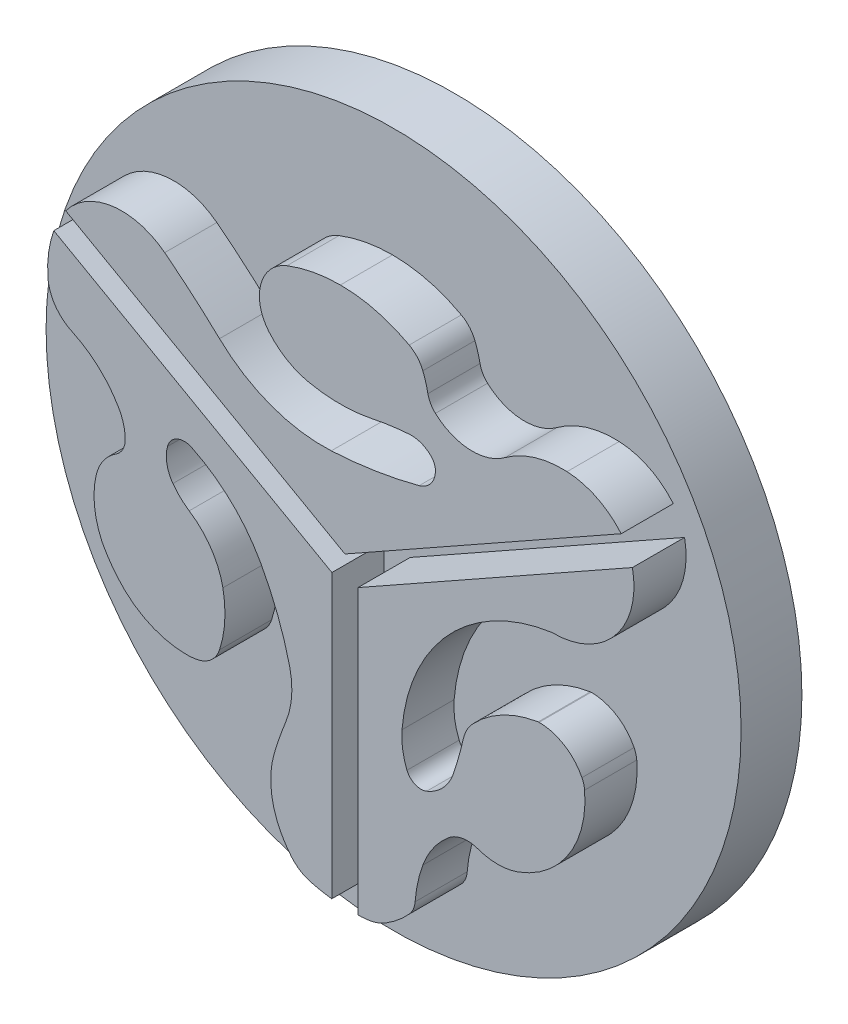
ISO-10303-21;
HEADER;
FILE_DESCRIPTION(('STEP AP214'),'2;1');
FILE_NAME('part.step','',(''),(''),'','','');
FILE_SCHEMA(('AUTOMOTIVE_DESIGN { 1 0 10303 214 1 1 1 1 }'));
ENDSEC;
DATA;
#1=APPLICATION_CONTEXT('core data for automotive mechanical design processes');
#2=APPLICATION_PROTOCOL_DEFINITION('international standard','automotive_design',2000,#1);
#3=PRODUCT_CONTEXT('',#1,'mechanical');
#4=PRODUCT('Part','Part','',(#3));
#5=PRODUCT_RELATED_PRODUCT_CATEGORY('part','',(#4));
#6=PRODUCT_DEFINITION_FORMATION('','',#4);
#7=PRODUCT_DEFINITION_CONTEXT('part definition',#1,'design');
#8=PRODUCT_DEFINITION('design','',#6,#7);
#9=PRODUCT_DEFINITION_SHAPE('','',#8);
#10=(LENGTH_UNIT() NAMED_UNIT(*) SI_UNIT(.MILLI.,.METRE.));
#11=(NAMED_UNIT(*) PLANE_ANGLE_UNIT() SI_UNIT($,.RADIAN.));
#12=(NAMED_UNIT(*) SI_UNIT($,.STERADIAN.) SOLID_ANGLE_UNIT());
#13=UNCERTAINTY_MEASURE_WITH_UNIT(LENGTH_MEASURE(1.E-05),#10,'distance_accuracy_value','');
#14=(GEOMETRIC_REPRESENTATION_CONTEXT(3) GLOBAL_UNCERTAINTY_ASSIGNED_CONTEXT((#13)) GLOBAL_UNIT_ASSIGNED_CONTEXT((#10,
#11,#12)) REPRESENTATION_CONTEXT('',''));
#15=CARTESIAN_POINT('',(0.,0.,0.));
#16=DIRECTION('',(0.,0.,1.));
#17=DIRECTION('',(1.,0.,0.));
#18=AXIS2_PLACEMENT_3D('',#15,#16,#17);
#19=CARTESIAN_POINT('',(0.,0.,7.));
#20=DIRECTION('',(0.,0.,1.));
#21=DIRECTION('',(1.,0.,0.));
#22=AXIS2_PLACEMENT_3D('',#19,#20,#21);
#23=PLANE('',#22);
#24=DIRECTION('',(0.00046731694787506,0.999999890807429,0.));
#25=VECTOR('',#24,1.);
#26=CARTESIAN_POINT('',(-1.10078111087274,-1.83289660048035,7.));
#27=LINE('',#26,#25);
#28=CARTESIAN_POINT('',(-1.11598450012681,-34.3662503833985,7.));
#29=VERTEX_POINT('',#28);
#30=CARTESIAN_POINT('',(-1.10078111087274,-1.83289660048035,7.));
#31=VERTEX_POINT('',#30);
#32=EDGE_CURVE('E505',#29,#31,#27,.T.);
#33=ORIENTED_EDGE('',*,*,#32,.F.);
#34=CARTESIAN_POINT('',(1.07327523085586,-16.3829963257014,7.));
#35=DIRECTION('',(0.,0.,1.));
#36=DIRECTION('',(-1.,0.,0.));
#37=AXIS2_PLACEMENT_3D('',#34,#35,#36);
#38=CIRCLE('',#37,18.1160228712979);
#39=CARTESIAN_POINT('',(-3.56729908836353,-33.8945740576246,7.));
#40=VERTEX_POINT('',#39);
#41=EDGE_CURVE('E502',#40,#29,#38,.T.);
#42=ORIENTED_EDGE('',*,*,#41,.F.);
#43=CARTESIAN_POINT('',(-2.47712333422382,-29.7807088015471,7.));
#44=DIRECTION('',(0.,0.,1.));
#45=DIRECTION('',(-1.,0.,0.));
#46=AXIS2_PLACEMENT_3D('',#43,#44,#45);
#47=CIRCLE('',#46,4.25586307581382);
#48=CARTESIAN_POINT('',(-5.75492251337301,-32.495189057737,7.));
#49=VERTEX_POINT('',#48);
#50=EDGE_CURVE('E515',#49,#40,#47,.T.);
#51=ORIENTED_EDGE('',*,*,#50,.F.);
#52=CARTESIAN_POINT('',(2.56098625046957,-25.6084431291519,7.));
#53=DIRECTION('',(0.,0.,1.));
#54=DIRECTION('',(-1.,0.,0.));
#55=AXIS2_PLACEMENT_3D('',#52,#53,#54);
#56=CIRCLE('',#55,10.7972963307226);
#57=CARTESIAN_POINT('',(-6.95454500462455,-30.7110182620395,7.));
#58=VERTEX_POINT('',#57);
#59=EDGE_CURVE('E615',#58,#49,#56,.T.);
#60=ORIENTED_EDGE('',*,*,#59,.F.);
#61=CARTESIAN_POINT('',(1.85363863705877,-25.987748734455,7.));
#62=DIRECTION('',(0.,0.,1.));
#63=DIRECTION('',(-1.,0.,0.));
#64=AXIS2_PLACEMENT_3D('',#61,#62,#63);
#65=CIRCLE('',#64,9.99466728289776);
#66=CARTESIAN_POINT('',(-7.72848408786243,-23.1458658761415,7.));
#67=VERTEX_POINT('',#66);
#68=EDGE_CURVE('E613',#67,#58,#65,.T.);
#69=ORIENTED_EDGE('',*,*,#68,.F.);
#70=CARTESIAN_POINT('',(32.0373488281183,-34.9396867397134,7.));
#71=DIRECTION('',(0.,0.,1.));
#72=DIRECTION('',(-1.,0.,0.));
#73=AXIS2_PLACEMENT_3D('',#70,#71,#72);
#74=CIRCLE('',#73,41.4778938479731);
#75=CARTESIAN_POINT('',(-6.39924879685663,-19.3498297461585,7.));
#76=VERTEX_POINT('',#75);
#77=EDGE_CURVE('E611',#76,#67,#74,.T.);
#78=ORIENTED_EDGE('',*,*,#77,.F.);
#79=CARTESIAN_POINT('',(-15.1408799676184,-15.8042302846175,7.));
#80=DIRECTION('',(0.,0.,-1.));
#81=DIRECTION('',(1.,0.,0.));
#82=AXIS2_PLACEMENT_3D('',#79,#80,#81);
#83=CIRCLE('',#82,9.43331283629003);
#84=CARTESIAN_POINT('',(-5.96413317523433,-13.6191194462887,7.));
#85=VERTEX_POINT('',#84);
#86=EDGE_CURVE('E609',#85,#76,#83,.T.);
#87=ORIENTED_EDGE('',*,*,#86,.F.);
#88=CARTESIAN_POINT('',(-39.5360609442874,-21.6130616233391,7.));
#89=DIRECTION('',(0.,0.,-1.));
#90=DIRECTION('',(1.,0.,0.));
#91=AXIS2_PLACEMENT_3D('',#88,#89,#90);
#92=CIRCLE('',#91,34.5105410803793);
#93=CARTESIAN_POINT('',(-9.31744897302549,-4.94534023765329,7.));
#94=VERTEX_POINT('',#93);
#95=EDGE_CURVE('E607',#94,#85,#92,.T.);
#96=ORIENTED_EDGE('',*,*,#95,.F.);
#97=CARTESIAN_POINT('',(-25.0336090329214,-13.6139242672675,7.));
#98=DIRECTION('',(0.,0.,-1.));
#99=DIRECTION('',(1.,0.,0.));
#100=AXIS2_PLACEMENT_3D('',#97,#98,#99);
#101=CIRCLE('',#100,17.948315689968);
#102=CARTESIAN_POINT('',(-17.2380979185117,2.55308048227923,7.));
#103=VERTEX_POINT('',#102);
#104=EDGE_CURVE('E605',#103,#94,#101,.T.);
#105=ORIENTED_EDGE('',*,*,#104,.F.);
#106=CARTESIAN_POINT('',(-18.1014903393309,0.762502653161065,7.));
#107=DIRECTION('',(0.,0.,-1.));
#108=DIRECTION('',(1.,0.,0.));
#109=AXIS2_PLACEMENT_3D('',#106,#107,#108);
#110=CIRCLE('',#109,1.98786705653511);
#111=CARTESIAN_POINT('',(-20.0199867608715,1.28306668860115,7.));
#112=VERTEX_POINT('',#111);
#113=EDGE_CURVE('E603',#112,#103,#110,.T.);
#114=ORIENTED_EDGE('',*,*,#113,.F.);
#115=CARTESIAN_POINT('',(-16.1539048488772,0.234045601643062,7.));
#116=DIRECTION('',(0.,0.,-1.));
#117=DIRECTION('',(1.,0.,0.));
#118=AXIS2_PLACEMENT_3D('',#115,#116,#117);
#119=CIRCLE('',#118,4.00587500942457);
#120=CARTESIAN_POINT('',(-19.4005948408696,-2.11244937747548,7.));
#121=VERTEX_POINT('',#120);
#122=EDGE_CURVE('E601',#121,#112,#119,.T.);
#123=ORIENTED_EDGE('',*,*,#122,.F.);
#124=CARTESIAN_POINT('',(-13.6493814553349,2.04415114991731,7.));
#125=DIRECTION('',(0.,0.,-1.));
#126=DIRECTION('',(1.,0.,0.));
#127=AXIS2_PLACEMENT_3D('',#124,#125,#126);
#128=CIRCLE('',#127,7.0960399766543);
#129=CARTESIAN_POINT('',(-17.5277512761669,-3.89824154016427,7.));
#130=VERTEX_POINT('',#129);
#131=EDGE_CURVE('E599',#130,#121,#128,.T.);
#132=ORIENTED_EDGE('',*,*,#131,.F.);
#133=CARTESIAN_POINT('',(-22.4101257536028,-11.3789583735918,7.));
#134=DIRECTION('',(0.,0.,1.));
#135=DIRECTION('',(-1.,0.,0.));
#136=AXIS2_PLACEMENT_3D('',#133,#134,#135);
#137=CIRCLE('',#136,8.93301208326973);
#138=CARTESIAN_POINT('',(-13.6493814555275,-9.63308775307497,7.));
#139=VERTEX_POINT('',#138);
#140=EDGE_CURVE('E597',#139,#130,#137,.T.);
#141=ORIENTED_EDGE('',*,*,#140,.F.);
#142=CARTESIAN_POINT('',(-25.9588377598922,-12.0861576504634,7.));
#143=DIRECTION('',(0.,0.,1.));
#144=DIRECTION('',(-1.,0.,0.));
#145=AXIS2_PLACEMENT_3D('',#142,#143,#144);
#146=CIRCLE('',#145,12.5515045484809);
#147=CARTESIAN_POINT('',(-14.0367150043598,-16.0108557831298,7.));
#148=VERTEX_POINT('',#147);
#149=EDGE_CURVE('E595',#148,#139,#146,.T.);
#150=ORIENTED_EDGE('',*,*,#149,.F.);
#151=CARTESIAN_POINT('',(-17.2295930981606,-14.9597776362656,7.));
#152=DIRECTION('',(0.,0.,1.));
#153=DIRECTION('',(-1.,0.,0.));
#154=AXIS2_PLACEMENT_3D('',#151,#152,#153);
#155=CIRCLE('',#154,3.36143359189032);
#156=CARTESIAN_POINT('',(-16.5836833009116,-18.2585707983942,7.));
#157=VERTEX_POINT('',#156);
#158=EDGE_CURVE('E593',#157,#148,#155,.T.);
#159=ORIENTED_EDGE('',*,*,#158,.F.);
#160=CARTESIAN_POINT('',(-17.8177342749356,-11.9560206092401,7.));
#161=DIRECTION('',(0.,0.,1.));
#162=DIRECTION('',(-1.,0.,0.));
#163=AXIS2_PLACEMENT_3D('',#160,#161,#162);
#164=CIRCLE('',#163,6.42222863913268);
#165=CARTESIAN_POINT('',(-17.8650221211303,-18.3780751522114,7.));
#166=VERTEX_POINT('',#165);
#167=EDGE_CURVE('E591',#166,#157,#164,.T.);
#168=ORIENTED_EDGE('',*,*,#167,.F.);
#169=CARTESIAN_POINT('',(-17.7884322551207,-7.97658012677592,7.));
#170=DIRECTION('',(0.,0.,1.));
#171=DIRECTION('',(-1.,0.,0.));
#172=AXIS2_PLACEMENT_3D('',#169,#170,#171);
#173=CIRCLE('',#172,10.4017770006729);
#174=CARTESIAN_POINT('',(-25.7378739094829,-14.6850331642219,7.));
#175=VERTEX_POINT('',#174);
#176=EDGE_CURVE('E589',#175,#166,#173,.T.);
#177=ORIENTED_EDGE('',*,*,#176,.F.);
#178=CARTESIAN_POINT('',(-13.9052078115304,-4.69956647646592,7.));
#179=DIRECTION('',(0.,0.,1.));
#180=DIRECTION('',(-1.,0.,0.));
#181=AXIS2_PLACEMENT_3D('',#178,#179,#180);
#182=CIRCLE('',#181,15.4829432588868);
#183=CARTESIAN_POINT('',(-27.4178629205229,-12.2579845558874,7.));
#184=VERTEX_POINT('',#183);
#185=EDGE_CURVE('E587',#184,#175,#182,.T.);
#186=ORIENTED_EDGE('',*,*,#185,.F.);
#187=CARTESIAN_POINT('',(-22.9584224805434,-9.76355877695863,7.));
#188=DIRECTION('',(0.,0.,1.));
#189=DIRECTION('',(-1.,0.,0.));
#190=AXIS2_PLACEMENT_3D('',#187,#188,#189);
#191=CIRCLE('',#190,5.1096740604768);
#192=CARTESIAN_POINT('',(-27.600631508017,-11.898661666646,7.));
#193=VERTEX_POINT('',#192);
#194=EDGE_CURVE('E585',#193,#184,#191,.T.);
#195=ORIENTED_EDGE('',*,*,#194,.F.);
#196=CARTESIAN_POINT('',(-18.8348461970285,-7.86699195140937,7.));
#197=DIRECTION('',(0.,0.,1.));
#198=DIRECTION('',(-1.,0.,0.));
#199=AXIS2_PLACEMENT_3D('',#196,#197,#198);
#200=CIRCLE('',#199,9.64848966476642);
#201=CARTESIAN_POINT('',(-28.228901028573,-5.66583620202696,7.));
#202=VERTEX_POINT('',#201);
#203=EDGE_CURVE('E583',#202,#193,#200,.T.);
#204=ORIENTED_EDGE('',*,*,#203,.F.);
#205=CARTESIAN_POINT('',(-23.1167404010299,-6.8636854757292,7.));
#206=DIRECTION('',(0.,0.,1.));
#207=DIRECTION('',(-1.,0.,0.));
#208=AXIS2_PLACEMENT_3D('',#205,#206,#207);
#209=CIRCLE('',#208,5.25062178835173);
#210=CARTESIAN_POINT('',(-25.9588377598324,-2.44876625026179,7.));
#211=VERTEX_POINT('',#210);
#212=EDGE_CURVE('E581',#211,#202,#209,.T.);
#213=ORIENTED_EDGE('',*,*,#212,.F.);
#214=CARTESIAN_POINT('',(-27.2231235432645,-0.484822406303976,7.));
#215=DIRECTION('',(0.,0.,-1.));
#216=DIRECTION('',(1.,0.,0.));
#217=AXIS2_PLACEMENT_3D('',#214,#215,#216);
#218=CIRCLE('',#217,2.33569988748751);
#219=CARTESIAN_POINT('',(-24.887423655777,-0.484822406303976,7.));
#220=VERTEX_POINT('',#219);
#221=EDGE_CURVE('E579',#220,#211,#218,.T.);
#222=ORIENTED_EDGE('',*,*,#221,.F.);
#223=CARTESIAN_POINT('',(-30.4764075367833,-0.48482240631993,7.));
#224=DIRECTION('',(0.,0.,-1.));
#225=DIRECTION('',(1.,0.,0.));
#226=AXIS2_PLACEMENT_3D('',#223,#224,#225);
#227=CIRCLE('',#226,5.5889838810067);
#228=CARTESIAN_POINT('',(-25.6250932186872,2.29033348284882,7.));
#229=VERTEX_POINT('',#228);
#230=EDGE_CURVE('E577',#229,#220,#227,.T.);
#231=ORIENTED_EDGE('',*,*,#230,.F.);
#232=CARTESIAN_POINT('',(-36.0445957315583,-3.67006031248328,7.));
#233=DIRECTION('',(0.,0.,-1.));
#234=DIRECTION('',(1.,0.,0.));
#235=AXIS2_PLACEMENT_3D('',#232,#233,#234);
#236=CIRCLE('',#235,12.0038463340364);
#237=CARTESIAN_POINT('',(-31.0189193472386,7.2310819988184,7.));
#238=VERTEX_POINT('',#237);
#239=EDGE_CURVE('E575',#238,#229,#236,.T.);
#240=ORIENTED_EDGE('',*,*,#239,.F.);
#241=CARTESIAN_POINT('',(-29.0126925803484,11.5827675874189,7.));
#242=DIRECTION('',(0.,0.,1.));
#243=DIRECTION('',(-1.,0.,0.));
#244=AXIS2_PLACEMENT_3D('',#241,#242,#243);
#245=CIRCLE('',#244,4.79187993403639);
#246=CARTESIAN_POINT('',(-33.7943276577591,11.2695914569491,7.));
#247=VERTEX_POINT('',#246);
#248=EDGE_CURVE('E573',#247,#238,#245,.T.);
#249=ORIENTED_EDGE('',*,*,#248,.F.);
#250=CARTESIAN_POINT('',(-21.3034803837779,12.0876871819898,7.));
#251=DIRECTION('',(0.,0.,1.));
#252=DIRECTION('',(-1.,0.,0.));
#253=AXIS2_PLACEMENT_3D('',#250,#251,#252);
#254=CIRCLE('',#253,12.5176094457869);
#255=CARTESIAN_POINT('',(-33.1124052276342,16.2397758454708,7.));
#256=VERTEX_POINT('',#255);
#257=EDGE_CURVE('E571',#256,#247,#254,.T.);
#258=ORIENTED_EDGE('',*,*,#257,.F.);
#259=DIRECTION('',(-0.870805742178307,0.491627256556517,0.));
#260=VECTOR('',#259,1.);
#261=CARTESIAN_POINT('',(-33.1124052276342,16.2397758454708,7.));
#262=LINE('',#261,#260);
#263=EDGE_CURVE('E569',#31,#256,#262,.T.);
#264=ORIENTED_EDGE('',*,*,#263,.F.);
#265=EDGE_LOOP('',(#33,#42,#51,#60,#69,#78,#87,#96,#105,#114,#123,#132,#141,#150,#159,#168,#177,
#186,#195,#204,#213,#222,#231,#240,#249,#258,#264));
#266=FACE_BOUND('',#265,.T.);
#267=CARTESIAN_POINT('',(0.,0.,7.));
#268=DIRECTION('',(0.,0.,1.));
#269=DIRECTION('',(1.,0.,0.));
#270=AXIS2_PLACEMENT_3D('',#267,#268,#269);
#271=CIRCLE('',#270,40.);
#272=CARTESIAN_POINT('',(40.,0.,7.));
#273=VERTEX_POINT('',#272);
#274=EDGE_CURVE('E11',#273,#273,#271,.T.);
#275=ORIENTED_EDGE('',*,*,#274,.T.);
#276=EDGE_LOOP('',(#275));
#277=FACE_BOUND('',#276,.T.);
#278=DIRECTION('',(-0.871299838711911,-0.490751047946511,0.));
#279=VECTOR('',#278,1.);
#280=CARTESIAN_POINT('',(1.89921888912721,-1.83380919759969,7.));
#281=LINE('',#280,#279);
#282=CARTESIAN_POINT('',(33.4908455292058,15.9598631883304,7.));
#283=VERTEX_POINT('',#282);
#284=CARTESIAN_POINT('',(1.89921888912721,-1.83380919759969,7.));
#285=VERTEX_POINT('',#284);
#286=EDGE_CURVE('E745',#283,#285,#281,.T.);
#287=ORIENTED_EDGE('',*,*,#286,.F.);
#288=CARTESIAN_POINT('',(24.3610423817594,14.1590430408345,7.));
#289=DIRECTION('',(0.,0.,1.));
#290=DIRECTION('',(-1.,0.,0.));
#291=AXIS2_PLACEMENT_3D('',#288,#289,#290);
#292=CIRCLE('',#291,9.30571108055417);
#293=CARTESIAN_POINT('',(24.2350139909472,4.85418540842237,7.));
#294=VERTEX_POINT('',#293);
#295=EDGE_CURVE('E695',#294,#283,#292,.T.);
#296=ORIENTED_EDGE('',*,*,#295,.F.);
#297=CARTESIAN_POINT('',(27.0335352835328,-15.0808198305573,7.));
#298=DIRECTION('',(0.,0.,-1.));
#299=DIRECTION('',(1.,0.,0.));
#300=AXIS2_PLACEMENT_3D('',#297,#298,#299);
#301=CIRCLE('',#300,20.1304782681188);
#302=CARTESIAN_POINT('',(6.96776267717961,-13.4680814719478,7.));
#303=VERTEX_POINT('',#302);
#304=EDGE_CURVE('E700',#303,#294,#301,.T.);
#305=ORIENTED_EDGE('',*,*,#304,.F.);
#306=CARTESIAN_POINT('',(15.1928153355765,-14.1291503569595,7.));
#307=DIRECTION('',(0.,0.,-1.));
#308=DIRECTION('',(1.,0.,0.));
#309=AXIS2_PLACEMENT_3D('',#306,#307,#308);
#310=CIRCLE('',#309,8.25157580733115);
#311=CARTESIAN_POINT('',(7.54289359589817,-17.2222395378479,7.));
#312=VERTEX_POINT('',#311);
#313=EDGE_CURVE('E783',#312,#303,#310,.T.);
#314=ORIENTED_EDGE('',*,*,#313,.F.);
#315=CARTESIAN_POINT('',(9.15413356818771,-16.5707676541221,7.));
#316=DIRECTION('',(0.,0.,-1.));
#317=DIRECTION('',(1.,0.,0.));
#318=AXIS2_PLACEMENT_3D('',#315,#316,#317);
#319=CIRCLE('',#318,1.73796141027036);
#320=CARTESIAN_POINT('',(9.80560545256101,-18.1820076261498,7.));
#321=VERTEX_POINT('',#320);
#322=EDGE_CURVE('E781',#321,#312,#319,.T.);
#323=ORIENTED_EDGE('',*,*,#322,.F.);
#324=CARTESIAN_POINT('',(7.79603915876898,-13.211887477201,7.));
#325=DIRECTION('',(0.,0.,-1.));
#326=DIRECTION('',(1.,0.,0.));
#327=AXIS2_PLACEMENT_3D('',#324,#325,#326);
#328=CIRCLE('',#327,5.36101212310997);
#329=CARTESIAN_POINT('',(12.8798496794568,-14.9134519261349,7.));
#330=VERTEX_POINT('',#329);
#331=EDGE_CURVE('E779',#330,#321,#328,.T.);
#332=ORIENTED_EDGE('',*,*,#331,.F.);
#333=CARTESIAN_POINT('',(-28.8179128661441,-0.957103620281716,7.));
#334=DIRECTION('',(0.,0.,-1.));
#335=DIRECTION('',(1.,0.,0.));
#336=AXIS2_PLACEMENT_3D('',#333,#334,#335);
#337=CIRCLE('',#336,43.9713890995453);
#338=CARTESIAN_POINT('',(14.0284697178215,-10.8399452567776,7.));
#339=VERTEX_POINT('',#338);
#340=EDGE_CURVE('E777',#339,#330,#337,.T.);
#341=ORIENTED_EDGE('',*,*,#340,.F.);
#342=CARTESIAN_POINT('',(18.3207825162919,-11.8299996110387,7.));
#343=DIRECTION('',(0.,0.,1.));
#344=DIRECTION('',(-1.,0.,0.));
#345=AXIS2_PLACEMENT_3D('',#342,#343,#344);
#346=CIRCLE('',#345,4.40501495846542);
#347=CARTESIAN_POINT('',(15.1220874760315,-8.8013849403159,7.));
#348=VERTEX_POINT('',#347);
#349=EDGE_CURVE('E775',#348,#339,#346,.T.);
#350=ORIENTED_EDGE('',*,*,#349,.F.);
#351=CARTESIAN_POINT('',(24.6683802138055,-17.8400841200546,7.));
#352=DIRECTION('',(0.,0.,1.));
#353=DIRECTION('',(-1.,0.,0.));
#354=AXIS2_PLACEMENT_3D('',#351,#352,#353);
#355=CIRCLE('',#354,13.1464743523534);
#356=CARTESIAN_POINT('',(22.6395333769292,-4.85110539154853,7.));
#357=VERTEX_POINT('',#356);
#358=EDGE_CURVE('E773',#357,#348,#355,.T.);
#359=ORIENTED_EDGE('',*,*,#358,.F.);
#360=CARTESIAN_POINT('',(22.7485442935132,-5.54900946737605,7.));
#361=DIRECTION('',(0.,0.,1.));
#362=DIRECTION('',(-1.,0.,0.));
#363=AXIS2_PLACEMENT_3D('',#360,#361,#362);
#364=CIRCLE('',#363,0.706366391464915);
#365=CARTESIAN_POINT('',(22.7485442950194,-4.84264307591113,7.));
#366=VERTEX_POINT('',#365);
#367=EDGE_CURVE('E771',#366,#357,#364,.T.);
#368=ORIENTED_EDGE('',*,*,#367,.F.);
#369=CARTESIAN_POINT('',(22.7485442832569,-10.3591512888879,7.));
#370=DIRECTION('',(0.,0.,1.));
#371=DIRECTION('',(-1.,0.,0.));
#372=AXIS2_PLACEMENT_3D('',#369,#370,#371);
#373=CIRCLE('',#372,5.51650821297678);
#374=CARTESIAN_POINT('',(27.6814795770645,-7.88973592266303,7.));
#375=VERTEX_POINT('',#374);
#376=EDGE_CURVE('E769',#375,#366,#373,.T.);
#377=ORIENTED_EDGE('',*,*,#376,.F.);
#378=CARTESIAN_POINT('',(25.0015178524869,-9.23131821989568,7.));
#379=DIRECTION('',(0.,0.,1.));
#380=DIRECTION('',(-1.,0.,0.));
#381=AXIS2_PLACEMENT_3D('',#378,#379,#380);
#382=CIRCLE('',#381,2.99700482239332);
#383=CARTESIAN_POINT('',(27.9881053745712,-8.98165268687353,7.));
#384=VERTEX_POINT('',#383);
#385=EDGE_CURVE('E767',#384,#375,#382,.T.);
#386=ORIENTED_EDGE('',*,*,#385,.F.);
#387=CARTESIAN_POINT('',(16.3060508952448,-9.95822087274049,7.));
#388=DIRECTION('',(0.,0.,1.));
#389=DIRECTION('',(-1.,0.,0.));
#390=AXIS2_PLACEMENT_3D('',#387,#388,#389);
#391=CIRCLE('',#390,11.7228018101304);
#392=CARTESIAN_POINT('',(20.3920923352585,-20.9458660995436,7.));
#393=VERTEX_POINT('',#392);
#394=EDGE_CURVE('E765',#393,#384,#391,.T.);
#395=ORIENTED_EDGE('',*,*,#394,.F.);
#396=CARTESIAN_POINT('',(18.0002600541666,-14.5140653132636,7.));
#397=DIRECTION('',(0.,0.,1.));
#398=DIRECTION('',(-1.,0.,0.));
#399=AXIS2_PLACEMENT_3D('',#396,#397,#398);
#400=CIRCLE('',#399,6.86213691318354);
#401=CARTESIAN_POINT('',(15.6834352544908,-20.9732638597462,7.));
#402=VERTEX_POINT('',#401);
#403=EDGE_CURVE('E763',#402,#393,#400,.T.);
#404=ORIENTED_EDGE('',*,*,#403,.F.);
#405=CARTESIAN_POINT('',(14.5153364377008,-24.2298684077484,7.));
#406=DIRECTION('',(0.,0.,-1.));
#407=DIRECTION('',(1.,0.,0.));
#408=AXIS2_PLACEMENT_3D('',#405,#406,#407);
#409=CIRCLE('',#408,3.45975837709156);
#410=CARTESIAN_POINT('',(12.2837411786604,-21.5860244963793,7.));
#411=VERTEX_POINT('',#410);
#412=EDGE_CURVE('E761',#411,#402,#409,.T.);
#413=ORIENTED_EDGE('',*,*,#412,.F.);
#414=CARTESIAN_POINT('',(18.6764024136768,-29.159619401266,7.));
#415=DIRECTION('',(0.,0.,-1.));
#416=DIRECTION('',(1.,0.,0.));
#417=AXIS2_PLACEMENT_3D('',#414,#415,#416);
#418=CIRCLE('',#417,9.91087571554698);
#419=CARTESIAN_POINT('',(9.3649877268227,-25.7650628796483,7.));
#420=VERTEX_POINT('',#419);
#421=EDGE_CURVE('E759',#420,#411,#418,.T.);
#422=ORIENTED_EDGE('',*,*,#421,.F.);
#423=CARTESIAN_POINT('',(23.8961699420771,-31.0625306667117,7.));
#424=DIRECTION('',(0.,0.,-1.));
#425=DIRECTION('',(1.,0.,0.));
#426=AXIS2_PLACEMENT_3D('',#423,#424,#425);
#427=CIRCLE('',#426,15.4666874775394);
#428=CARTESIAN_POINT('',(8.47547504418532,-29.8706454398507,7.));
#429=VERTEX_POINT('',#428);
#430=EDGE_CURVE('E757',#429,#420,#427,.T.);
#431=ORIENTED_EDGE('',*,*,#430,.F.);
#432=CARTESIAN_POINT('',(5.86327418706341,-29.6687450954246,7.));
#433=DIRECTION('',(0.,0.,1.));
#434=DIRECTION('',(-1.,0.,0.));
#435=AXIS2_PLACEMENT_3D('',#432,#433,#434);
#436=CIRCLE('',#435,2.61999180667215);
#437=CARTESIAN_POINT('',(7.79603915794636,-31.4375799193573,7.));
#438=VERTEX_POINT('',#437);
#439=EDGE_CURVE('E755',#438,#429,#436,.T.);
#440=ORIENTED_EDGE('',*,*,#439,.F.);
#441=CARTESIAN_POINT('',(-1.51338409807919,-22.917748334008,7.));
#442=DIRECTION('',(0.,0.,1.));
#443=DIRECTION('',(-1.,0.,0.));
#444=AXIS2_PLACEMENT_3D('',#441,#442,#443);
#445=CIRCLE('',#444,12.6195440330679);
#446=CARTESIAN_POINT('',(5.1100136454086,-33.6594192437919,7.));
#447=VERTEX_POINT('',#446);
#448=EDGE_CURVE('E753',#447,#438,#445,.T.);
#449=ORIENTED_EDGE('',*,*,#448,.F.);
#450=CARTESIAN_POINT('',(2.38363072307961,-29.2378354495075,7.));
#451=DIRECTION('',(0.,0.,1.));
#452=DIRECTION('',(-1.,0.,0.));
#453=AXIS2_PLACEMENT_3D('',#450,#451,#452);
#454=CIRCLE('',#453,5.19457092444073);
#455=CARTESIAN_POINT('',(2.91040856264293,-34.405627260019,7.));
#456=VERTEX_POINT('',#455);
#457=EDGE_CURVE('E751',#456,#447,#454,.T.);
#458=ORIENTED_EDGE('',*,*,#457,.F.);
#459=CARTESIAN_POINT('',(1.07327523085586,-16.3829963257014,7.));
#460=DIRECTION('',(0.,0.,1.));
#461=DIRECTION('',(-1.,0.,0.));
#462=AXIS2_PLACEMENT_3D('',#459,#460,#461);
#463=CIRCLE('',#462,18.1160228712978);
#464=CARTESIAN_POINT('',(1.8981589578,-34.4802295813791,7.));
#465=VERTEX_POINT('',#464);
#466=EDGE_CURVE('E749',#465,#456,#463,.T.);
#467=ORIENTED_EDGE('',*,*,#466,.F.);
#468=DIRECTION('',(-3.24669998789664E-05,-0.999999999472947,0.));
#469=VECTOR('',#468,1.);
#470=CARTESIAN_POINT('',(1.89921888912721,-1.83380919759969,7.));
#471=LINE('',#470,#469);
#472=EDGE_CURVE('E747',#285,#465,#471,.T.);
#473=ORIENTED_EDGE('',*,*,#472,.F.);
#474=EDGE_LOOP('',(#287,#296,#305,#314,#323,#332,#341,#350,#359,#368,#377,#386,#395,#404,#413,
#422,#431,#440,#449,#458,#467,#473));
#475=FACE_BOUND('',#474,.T.);
#476=CARTESIAN_POINT('',(-25.2925791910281,14.0567564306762,7.));
#477=DIRECTION('',(0.,0.,1.));
#478=DIRECTION('',(-1.,0.,0.));
#479=AXIS2_PLACEMENT_3D('',#476,#477,#478);
#480=CIRCLE('',#479,8.06899808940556);
#481=CARTESIAN_POINT('',(-20.3460301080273,20.4317373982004,7.));
#482=VERTEX_POINT('',#481);
#483=CARTESIAN_POINT('',(-31.7434579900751,18.9039095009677,7.));
#484=VERTEX_POINT('',#483);
#485=EDGE_CURVE('E1621',#482,#484,#480,.T.);
#486=ORIENTED_EDGE('',*,*,#485,.F.);
#487=CARTESIAN_POINT('',(-71.3939305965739,-45.3574397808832,7.));
#488=DIRECTION('',(0.,0.,1.));
#489=DIRECTION('',(-1.,0.,0.));
#490=AXIS2_PLACEMENT_3D('',#487,#488,#489);
#491=CIRCLE('',#490,83.2712674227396);
#492=CARTESIAN_POINT('',(-14.036715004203,15.0102154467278,7.));
#493=VERTEX_POINT('',#492);
#494=EDGE_CURVE('E500',#493,#482,#491,.T.);
#495=ORIENTED_EDGE('',*,*,#494,.F.);
#496=CARTESIAN_POINT('',(-2.08277500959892,27.591567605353,7.));
#497=DIRECTION('',(0.,0.,-1.));
#498=DIRECTION('',(1.,0.,0.));
#499=AXIS2_PLACEMENT_3D('',#496,#497,#498);
#500=CIRCLE('',#499,17.3547429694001);
#501=CARTESIAN_POINT('',(-1.17412062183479,10.2606284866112,7.));
#502=VERTEX_POINT('',#501);
#503=EDGE_CURVE('E496',#502,#493,#500,.T.);
#504=ORIENTED_EDGE('',*,*,#503,.F.);
#505=CARTESIAN_POINT('',(-3.77123865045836,59.7959579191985,7.));
#506=DIRECTION('',(0.,0.,-1.));
#507=DIRECTION('',(1.,0.,0.));
#508=AXIS2_PLACEMENT_3D('',#505,#506,#507);
#509=CIRCLE('',#508,49.6033656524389);
#510=CARTESIAN_POINT('',(8.94999985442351,11.851573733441,7.));
#511=VERTEX_POINT('',#510);
#512=EDGE_CURVE('E1617',#511,#502,#509,.T.);
#513=ORIENTED_EDGE('',*,*,#512,.F.);
#514=CARTESIAN_POINT('',(8.30690247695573,14.275308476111,7.));
#515=DIRECTION('',(0.,0.,-1.));
#516=DIRECTION('',(1.,0.,0.));
#517=AXIS2_PLACEMENT_3D('',#514,#515,#516);
#518=CIRCLE('',#517,2.50760131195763);
#519=CARTESIAN_POINT('',(10.8145037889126,14.2753084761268,7.));
#520=VERTEX_POINT('',#519);
#521=EDGE_CURVE('E1661',#520,#511,#518,.T.);
#522=ORIENTED_EDGE('',*,*,#521,.F.);
#523=CARTESIAN_POINT('',(9.10776352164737,14.2753084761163,7.));
#524=DIRECTION('',(0.,0.,-1.));
#525=DIRECTION('',(1.,0.,0.));
#526=AXIS2_PLACEMENT_3D('',#523,#524,#525);
#527=CIRCLE('',#526,1.70674026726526);
#528=CARTESIAN_POINT('',(10.2944507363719,15.5019852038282,7.));
#529=VERTEX_POINT('',#528);
#530=EDGE_CURVE('E1659',#529,#520,#527,.T.);
#531=ORIENTED_EDGE('',*,*,#530,.F.);
#532=CARTESIAN_POINT('',(8.02904741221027,13.1602413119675,7.));
#533=DIRECTION('',(0.,0.,-1.));
#534=DIRECTION('',(1.,0.,0.));
#535=AXIS2_PLACEMENT_3D('',#532,#533,#534);
#536=CIRCLE('',#535,3.25819224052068);
#537=CARTESIAN_POINT('',(7.79603915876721,16.4100911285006,7.));
#538=VERTEX_POINT('',#537);
#539=EDGE_CURVE('E1657',#538,#529,#536,.T.);
#540=ORIENTED_EDGE('',*,*,#539,.F.);
#541=CARTESIAN_POINT('',(10.0846101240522,-15.5094302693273,7.));
#542=DIRECTION('',(0.,0.,-1.));
#543=DIRECTION('',(1.,0.,0.));
#544=AXIS2_PLACEMENT_3D('',#541,#542,#543);
#545=CIRCLE('',#544,32.0014593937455);
#546=CARTESIAN_POINT('',(3.5292085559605,15.8134066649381,7.));
#547=VERTEX_POINT('',#546);
#548=EDGE_CURVE('E1655',#547,#538,#545,.T.);
#549=ORIENTED_EDGE('',*,*,#548,.F.);
#550=CARTESIAN_POINT('',(-0.121015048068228,33.2548032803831,7.));
#551=DIRECTION('',(0.,0.,1.));
#552=DIRECTION('',(-1.,0.,0.));
#553=AXIS2_PLACEMENT_3D('',#550,#551,#552);
#554=CIRCLE('',#553,17.8192718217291);
#555=CARTESIAN_POINT('',(-3.77123865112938,15.8134066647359,7.));
#556=VERTEX_POINT('',#555);
#557=EDGE_CURVE('E1653',#556,#547,#554,.T.);
#558=ORIENTED_EDGE('',*,*,#557,.F.);
#559=CARTESIAN_POINT('',(-2.09571116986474,23.8193653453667,7.));
#560=DIRECTION('',(0.,0.,1.));
#561=DIRECTION('',(-1.,0.,0.));
#562=AXIS2_PLACEMENT_3D('',#559,#560,#561);
#563=CIRCLE('',#562,8.17941114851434);
#564=CARTESIAN_POINT('',(-8.33799662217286,18.5338531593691,7.));
#565=VERTEX_POINT('',#564);
#566=EDGE_CURVE('E1651',#565,#556,#563,.T.);
#567=ORIENTED_EDGE('',*,*,#566,.F.);
#568=CARTESIAN_POINT('',(-4.76273679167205,21.5611225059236,7.));
#569=DIRECTION('',(0.,0.,1.));
#570=DIRECTION('',(-1.,0.,0.));
#571=AXIS2_PLACEMENT_3D('',#568,#569,#570);
#572=CIRCLE('',#571,4.68474572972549);
#573=CARTESIAN_POINT('',(-9.41333168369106,22.1257548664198,7.));
#574=VERTEX_POINT('',#573);
#575=EDGE_CURVE('E1649',#574,#565,#572,.T.);
#576=ORIENTED_EDGE('',*,*,#575,.F.);
#577=CARTESIAN_POINT('',(-4.47477124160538,21.5261603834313,7.));
#578=DIRECTION('',(0.,0.,1.));
#579=DIRECTION('',(-1.,0.,0.));
#580=AXIS2_PLACEMENT_3D('',#577,#578,#579);
#581=CIRCLE('',#580,4.97482590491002);
#582=CARTESIAN_POINT('',(-6.28177706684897,26.1612032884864,7.));
#583=VERTEX_POINT('',#582);
#584=EDGE_CURVE('E1647',#583,#574,#581,.T.);
#585=ORIENTED_EDGE('',*,*,#584,.F.);
#586=CARTESIAN_POINT('',(-0.121015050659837,10.3585999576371,7.));
#587=DIRECTION('',(0.,0.,1.));
#588=DIRECTION('',(-1.,0.,0.));
#589=AXIS2_PLACEMENT_3D('',#586,#587,#588);
#590=CIRCLE('',#589,16.9610512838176);
#591=CARTESIAN_POINT('',(-0.121015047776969,27.3196512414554,7.));
#592=VERTEX_POINT('',#591);
#593=EDGE_CURVE('E1645',#592,#583,#590,.T.);
#594=ORIENTED_EDGE('',*,*,#593,.F.);
#595=CARTESIAN_POINT('',(-0.121015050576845,10.8453332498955,7.));
#596=DIRECTION('',(0.,0.,1.));
#597=DIRECTION('',(-1.,0.,0.));
#598=AXIS2_PLACEMENT_3D('',#595,#596,#597);
#599=CIRCLE('',#598,16.4743179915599);
#600=CARTESIAN_POINT('',(7.7960391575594,25.2925961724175,7.));
#601=VERTEX_POINT('',#600);
#602=EDGE_CURVE('E1643',#601,#592,#599,.T.);
#603=ORIENTED_EDGE('',*,*,#602,.F.);
#604=CARTESIAN_POINT('',(6.11955991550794,22.2333097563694,7.));
#605=DIRECTION('',(0.,0.,1.));
#606=DIRECTION('',(-1.,0.,0.));
#607=AXIS2_PLACEMENT_3D('',#604,#605,#606);
#608=CIRCLE('',#607,3.48852633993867);
#609=CARTESIAN_POINT('',(9.36498772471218,23.5127683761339,7.));
#610=VERTEX_POINT('',#609);
#611=EDGE_CURVE('E1641',#610,#601,#608,.T.);
#612=ORIENTED_EDGE('',*,*,#611,.F.);
#613=CARTESIAN_POINT('',(-1.38873519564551,19.2732830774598,7.));
#614=DIRECTION('',(0.,0.,1.));
#615=DIRECTION('',(-1.,0.,0.));
#616=AXIS2_PLACEMENT_3D('',#613,#614,#615);
#617=CIRCLE('',#616,11.5592297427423);
#618=CARTESIAN_POINT('',(9.94882780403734,21.5261606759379,7.));
#619=VERTEX_POINT('',#618);
#620=EDGE_CURVE('E1639',#619,#610,#617,.T.);
#621=ORIENTED_EDGE('',*,*,#620,.F.);
#622=CARTESIAN_POINT('',(12.7223395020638,22.0772828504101,7.));
#623=DIRECTION('',(0.,0.,-1.));
#624=DIRECTION('',(1.,0.,0.));
#625=AXIS2_PLACEMENT_3D('',#622,#623,#624);
#626=CIRCLE('',#625,2.82773810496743);
#627=CARTESIAN_POINT('',(10.8145037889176,19.9901159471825,7.));
#628=VERTEX_POINT('',#627);
#629=EDGE_CURVE('E1637',#628,#619,#626,.T.);
#630=ORIENTED_EDGE('',*,*,#629,.F.);
#631=CARTESIAN_POINT('',(15.0643344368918,24.6394187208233,7.));
#632=DIRECTION('',(0.,0.,-1.));
#633=DIRECTION('',(1.,0.,0.));
#634=AXIS2_PLACEMENT_3D('',#631,#632,#633);
#635=CIRCLE('',#634,6.29897426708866);
#636=CARTESIAN_POINT('',(18.8193381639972,19.5820455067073,7.));
#637=VERTEX_POINT('',#636);
#638=EDGE_CURVE('E1635',#637,#628,#635,.T.);
#639=ORIENTED_EDGE('',*,*,#638,.F.);
#640=CARTESIAN_POINT('',(25.4399130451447,10.6652186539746,7.));
#641=DIRECTION('',(0.,0.,1.));
#642=DIRECTION('',(-1.,0.,0.));
#643=AXIS2_PLACEMENT_3D('',#640,#641,#642);
#644=CIRCLE('',#643,11.1059359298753);
#645=CARTESIAN_POINT('',(25.9667463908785,21.7586518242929,7.));
#646=VERTEX_POINT('',#645);
#647=EDGE_CURVE('E1633',#646,#637,#644,.T.);
#648=ORIENTED_EDGE('',*,*,#647,.F.);
#649=CARTESIAN_POINT('',(25.5545947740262,13.0800507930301,7.));
#650=DIRECTION('',(0.,0.,1.));
#651=DIRECTION('',(-1.,0.,0.));
#652=AXIS2_PLACEMENT_3D('',#649,#650,#651);
#653=CIRCLE('',#652,8.68838217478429);
#654=CARTESIAN_POINT('',(32.1962225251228,18.6815475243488,7.));
#655=VERTEX_POINT('',#654);
#656=EDGE_CURVE('E1631',#655,#646,#653,.T.);
#657=ORIENTED_EDGE('',*,*,#656,.F.);
#658=DIRECTION('',(0.87120918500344,0.490911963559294,0.));
#659=VECTOR('',#658,1.);
#660=CARTESIAN_POINT('',(0.4,0.76490212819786,7.));
#661=LINE('',#660,#659);
#662=CARTESIAN_POINT('',(0.4,0.76490212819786,7.));
#663=VERTEX_POINT('',#662);
#664=EDGE_CURVE('E1629',#663,#655,#661,.T.);
#665=ORIENTED_EDGE('',*,*,#664,.F.);
#666=DIRECTION('',(0.870899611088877,-0.491460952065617,0.));
#667=VECTOR('',#666,1.);
#668=CARTESIAN_POINT('',(-31.7434579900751,18.9039095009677,7.));
#669=LINE('',#668,#667);
#670=EDGE_CURVE('E1623',#484,#663,#669,.T.);
#671=ORIENTED_EDGE('',*,*,#670,.F.);
#672=EDGE_LOOP('',(#486,#495,#504,#513,#522,#531,#540,#549,#558,#567,#576,#585,#594,#603,#612,
#621,#630,#639,#648,#657,#665,#671));
#673=FACE_BOUND('',#672,.T.);
#674=ADVANCED_FACE('F33',(#266,#277,#475,#673),#23,.T.);
#675=CARTESIAN_POINT('',(0.,0.,7.));
#676=DIRECTION('',(0.,0.,-1.));
#677=DIRECTION('',(-1.,0.,0.));
#678=AXIS2_PLACEMENT_3D('',#675,#676,#677);
#679=CYLINDRICAL_SURFACE('',#678,40.);
#680=ORIENTED_EDGE('',*,*,#274,.F.);
#681=EDGE_LOOP('',(#680));
#682=FACE_BOUND('',#681,.T.);
#683=CARTESIAN_POINT('',(0.,0.,0.));
#684=DIRECTION('',(0.,0.,1.));
#685=DIRECTION('',(1.,0.,0.));
#686=AXIS2_PLACEMENT_3D('',#683,#684,#685);
#687=CIRCLE('',#686,40.);
#688=CARTESIAN_POINT('',(40.,0.,0.));
#689=VERTEX_POINT('',#688);
#690=EDGE_CURVE('E37',#689,#689,#687,.T.);
#691=ORIENTED_EDGE('',*,*,#690,.T.);
#692=EDGE_LOOP('',(#691));
#693=FACE_BOUND('',#692,.T.);
#694=ADVANCED_FACE('F35',(#682,#693),#679,.T.);
#695=CARTESIAN_POINT('',(0.,0.,0.));
#696=DIRECTION('',(0.,0.,1.));
#697=DIRECTION('',(1.,0.,0.));
#698=AXIS2_PLACEMENT_3D('',#695,#696,#697);
#699=PLANE('',#698);
#700=ORIENTED_EDGE('',*,*,#690,.F.);
#701=EDGE_LOOP('',(#700));
#702=FACE_BOUND('',#701,.T.);
#703=ADVANCED_FACE('F855',(#702),#699,.F.);
#704=CARTESIAN_POINT('',(24.3610423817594,14.1590430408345,13.));
#705=DIRECTION('',(0.,0.,-1.));
#706=DIRECTION('',(-1.,0.,0.));
#707=AXIS2_PLACEMENT_3D('',#704,#705,#706);
#708=CYLINDRICAL_SURFACE('',#707,9.30571108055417);
#709=ORIENTED_EDGE('',*,*,#295,.T.);
#710=DIRECTION('',(0.,0.,-1.));
#711=VECTOR('',#710,1.);
#712=CARTESIAN_POINT('',(33.4908455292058,15.9598631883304,13.));
#713=LINE('',#712,#711);
#714=CARTESIAN_POINT('',(33.4908455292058,15.9598631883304,13.));
#715=VERTEX_POINT('',#714);
#716=EDGE_CURVE('E848',#715,#283,#713,.T.);
#717=ORIENTED_EDGE('',*,*,#716,.F.);
#718=CARTESIAN_POINT('',(24.3610423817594,14.1590430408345,13.));
#719=DIRECTION('',(0.,0.,1.));
#720=DIRECTION('',(-1.,0.,0.));
#721=AXIS2_PLACEMENT_3D('',#718,#719,#720);
#722=CIRCLE('',#721,9.30571108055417);
#723=CARTESIAN_POINT('',(24.2350139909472,4.85418540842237,13.));
#724=VERTEX_POINT('',#723);
#725=EDGE_CURVE('E696',#724,#715,#722,.T.);
#726=ORIENTED_EDGE('',*,*,#725,.F.);
#727=DIRECTION('',(0.,0.,-1.));
#728=VECTOR('',#727,1.);
#729=CARTESIAN_POINT('',(24.2350139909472,4.85418540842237,13.));
#730=LINE('',#729,#728);
#731=EDGE_CURVE('E742',#724,#294,#730,.T.);
#732=ORIENTED_EDGE('',*,*,#731,.T.);
#733=EDGE_LOOP('',(#709,#717,#726,#732));
#734=FACE_BOUND('',#733,.T.);
#735=ADVANCED_FACE('F857',(#734),#708,.T.);
#736=CARTESIAN_POINT('',(1.89921888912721,-1.83380919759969,13.));
#737=DIRECTION('',(0.490751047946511,-0.871299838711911,0.));
#738=DIRECTION('',(0.871299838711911,0.490751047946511,0.));
#739=AXIS2_PLACEMENT_3D('',#736,#737,#738);
#740=PLANE('',#739);
#741=ORIENTED_EDGE('',*,*,#286,.T.);
#742=DIRECTION('',(0.,0.,-1.));
#743=VECTOR('',#742,1.);
#744=CARTESIAN_POINT('',(1.89921888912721,-1.83380919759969,13.));
#745=LINE('',#744,#743);
#746=CARTESIAN_POINT('',(1.89921888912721,-1.83380919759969,13.));
#747=VERTEX_POINT('',#746);
#748=EDGE_CURVE('E845',#747,#285,#745,.T.);
#749=ORIENTED_EDGE('',*,*,#748,.F.);
#750=DIRECTION('',(-0.871299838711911,-0.490751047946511,0.));
#751=VECTOR('',#750,1.);
#752=CARTESIAN_POINT('',(1.89921888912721,-1.83380919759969,13.));
#753=LINE('',#752,#751);
#754=EDGE_CURVE('E699',#715,#747,#753,.T.);
#755=ORIENTED_EDGE('',*,*,#754,.F.);
#756=ORIENTED_EDGE('',*,*,#716,.T.);
#757=EDGE_LOOP('',(#741,#749,#755,#756));
#758=FACE_BOUND('',#757,.T.);
#759=ADVANCED_FACE('F862',(#758),#740,.F.);
#760=CARTESIAN_POINT('',(1.89921888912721,-1.83380919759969,13.));
#761=DIRECTION('',(0.999999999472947,-3.24669998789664E-05,0.));
#762=DIRECTION('',(3.24669998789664E-05,0.999999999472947,0.));
#763=AXIS2_PLACEMENT_3D('',#760,#761,#762);
#764=PLANE('',#763);
#765=ORIENTED_EDGE('',*,*,#472,.T.);
#766=DIRECTION('',(0.,0.,-1.));
#767=VECTOR('',#766,1.);
#768=CARTESIAN_POINT('',(1.8981589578,-34.4802295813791,13.));
#769=LINE('',#768,#767);
#770=CARTESIAN_POINT('',(1.8981589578,-34.4802295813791,13.));
#771=VERTEX_POINT('',#770);
#772=EDGE_CURVE('E842',#771,#465,#769,.T.);
#773=ORIENTED_EDGE('',*,*,#772,.F.);
#774=DIRECTION('',(-3.24669998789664E-05,-0.999999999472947,0.));
#775=VECTOR('',#774,1.);
#776=CARTESIAN_POINT('',(1.89921888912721,-1.83380919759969,13.));
#777=LINE('',#776,#775);
#778=EDGE_CURVE('E702',#747,#771,#777,.T.);
#779=ORIENTED_EDGE('',*,*,#778,.F.);
#780=ORIENTED_EDGE('',*,*,#748,.T.);
#781=EDGE_LOOP('',(#765,#773,#779,#780));
#782=FACE_BOUND('',#781,.T.);
#783=ADVANCED_FACE('F876',(#782),#764,.F.);
#784=CARTESIAN_POINT('',(1.07327523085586,-16.3829963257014,13.));
#785=DIRECTION('',(0.,0.,-1.));
#786=DIRECTION('',(-1.,0.,0.));
#787=AXIS2_PLACEMENT_3D('',#784,#785,#786);
#788=CYLINDRICAL_SURFACE('',#787,18.1160228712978);
#789=ORIENTED_EDGE('',*,*,#466,.T.);
#790=DIRECTION('',(0.,0.,-1.));
#791=VECTOR('',#790,1.);
#792=CARTESIAN_POINT('',(2.91040856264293,-34.405627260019,13.));
#793=LINE('',#792,#791);
#794=CARTESIAN_POINT('',(2.91040856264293,-34.405627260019,13.));
#795=VERTEX_POINT('',#794);
#796=EDGE_CURVE('E839',#795,#456,#793,.T.);
#797=ORIENTED_EDGE('',*,*,#796,.F.);
#798=CARTESIAN_POINT('',(1.07327523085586,-16.3829963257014,13.));
#799=DIRECTION('',(0.,0.,1.));
#800=DIRECTION('',(-1.,0.,0.));
#801=AXIS2_PLACEMENT_3D('',#798,#799,#800);
#802=CIRCLE('',#801,18.1160228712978);
#803=EDGE_CURVE('E704',#771,#795,#802,.T.);
#804=ORIENTED_EDGE('',*,*,#803,.F.);
#805=ORIENTED_EDGE('',*,*,#772,.T.);
#806=EDGE_LOOP('',(#789,#797,#804,#805));
#807=FACE_BOUND('',#806,.T.);
#808=ADVANCED_FACE('F879',(#807),#788,.T.);
#809=CARTESIAN_POINT('',(2.38363072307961,-29.2378354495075,13.));
#810=DIRECTION('',(0.,0.,-1.));
#811=DIRECTION('',(-1.,0.,0.));
#812=AXIS2_PLACEMENT_3D('',#809,#810,#811);
#813=CYLINDRICAL_SURFACE('',#812,5.19457092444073);
#814=ORIENTED_EDGE('',*,*,#457,.T.);
#815=DIRECTION('',(0.,0.,-1.));
#816=VECTOR('',#815,1.);
#817=CARTESIAN_POINT('',(5.1100136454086,-33.6594192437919,13.));
#818=LINE('',#817,#816);
#819=CARTESIAN_POINT('',(5.1100136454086,-33.6594192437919,13.));
#820=VERTEX_POINT('',#819);
#821=EDGE_CURVE('E836',#820,#447,#818,.T.);
#822=ORIENTED_EDGE('',*,*,#821,.F.);
#823=CARTESIAN_POINT('',(2.38363072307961,-29.2378354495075,13.));
#824=DIRECTION('',(0.,0.,1.));
#825=DIRECTION('',(-1.,0.,0.));
#826=AXIS2_PLACEMENT_3D('',#823,#824,#825);
#827=CIRCLE('',#826,5.19457092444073);
#828=EDGE_CURVE('E706',#795,#820,#827,.T.);
#829=ORIENTED_EDGE('',*,*,#828,.F.);
#830=ORIENTED_EDGE('',*,*,#796,.T.);
#831=EDGE_LOOP('',(#814,#822,#829,#830));
#832=FACE_BOUND('',#831,.T.);
#833=ADVANCED_FACE('F883',(#832),#813,.T.);
#834=CARTESIAN_POINT('',(-1.51338409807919,-22.917748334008,13.));
#835=DIRECTION('',(0.,0.,-1.));
#836=DIRECTION('',(-1.,0.,0.));
#837=AXIS2_PLACEMENT_3D('',#834,#835,#836);
#838=CYLINDRICAL_SURFACE('',#837,12.6195440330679);
#839=ORIENTED_EDGE('',*,*,#448,.T.);
#840=DIRECTION('',(0.,0.,-1.));
#841=VECTOR('',#840,1.);
#842=CARTESIAN_POINT('',(7.79603915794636,-31.4375799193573,13.));
#843=LINE('',#842,#841);
#844=CARTESIAN_POINT('',(7.79603915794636,-31.4375799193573,13.));
#845=VERTEX_POINT('',#844);
#846=EDGE_CURVE('E833',#845,#438,#843,.T.);
#847=ORIENTED_EDGE('',*,*,#846,.F.);
#848=CARTESIAN_POINT('',(-1.51338409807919,-22.917748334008,13.));
#849=DIRECTION('',(0.,0.,1.));
#850=DIRECTION('',(-1.,0.,0.));
#851=AXIS2_PLACEMENT_3D('',#848,#849,#850);
#852=CIRCLE('',#851,12.6195440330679);
#853=EDGE_CURVE('E708',#820,#845,#852,.T.);
#854=ORIENTED_EDGE('',*,*,#853,.F.);
#855=ORIENTED_EDGE('',*,*,#821,.T.);
#856=EDGE_LOOP('',(#839,#847,#854,#855));
#857=FACE_BOUND('',#856,.T.);
#858=ADVANCED_FACE('F887',(#857),#838,.T.);
#859=CARTESIAN_POINT('',(5.86327418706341,-29.6687450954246,13.));
#860=DIRECTION('',(0.,0.,-1.));
#861=DIRECTION('',(-1.,0.,0.));
#862=AXIS2_PLACEMENT_3D('',#859,#860,#861);
#863=CYLINDRICAL_SURFACE('',#862,2.61999180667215);
#864=ORIENTED_EDGE('',*,*,#439,.T.);
#865=DIRECTION('',(0.,0.,-1.));
#866=VECTOR('',#865,1.);
#867=CARTESIAN_POINT('',(8.47547504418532,-29.8706454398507,13.));
#868=LINE('',#867,#866);
#869=CARTESIAN_POINT('',(8.47547504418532,-29.8706454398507,13.));
#870=VERTEX_POINT('',#869);
#871=EDGE_CURVE('E830',#870,#429,#868,.T.);
#872=ORIENTED_EDGE('',*,*,#871,.F.);
#873=CARTESIAN_POINT('',(5.86327418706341,-29.6687450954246,13.));
#874=DIRECTION('',(0.,0.,1.));
#875=DIRECTION('',(-1.,0.,0.));
#876=AXIS2_PLACEMENT_3D('',#873,#874,#875);
#877=CIRCLE('',#876,2.61999180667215);
#878=EDGE_CURVE('E710',#845,#870,#877,.T.);
#879=ORIENTED_EDGE('',*,*,#878,.F.);
#880=ORIENTED_EDGE('',*,*,#846,.T.);
#881=EDGE_LOOP('',(#864,#872,#879,#880));
#882=FACE_BOUND('',#881,.T.);
#883=ADVANCED_FACE('F891',(#882),#863,.T.);
#884=CARTESIAN_POINT('',(23.8961699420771,-31.0625306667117,13.));
#885=DIRECTION('',(0.,0.,-1.));
#886=DIRECTION('',(-1.,0.,0.));
#887=AXIS2_PLACEMENT_3D('',#884,#885,#886);
#888=CYLINDRICAL_SURFACE('',#887,15.4666874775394);
#889=ORIENTED_EDGE('',*,*,#430,.T.);
#890=DIRECTION('',(0.,0.,-1.));
#891=VECTOR('',#890,1.);
#892=CARTESIAN_POINT('',(9.3649877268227,-25.7650628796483,13.));
#893=LINE('',#892,#891);
#894=CARTESIAN_POINT('',(9.3649877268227,-25.7650628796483,13.));
#895=VERTEX_POINT('',#894);
#896=EDGE_CURVE('E827',#895,#420,#893,.T.);
#897=ORIENTED_EDGE('',*,*,#896,.F.);
#898=CARTESIAN_POINT('',(23.8961699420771,-31.0625306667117,13.));
#899=DIRECTION('',(0.,0.,-1.));
#900=DIRECTION('',(1.,0.,0.));
#901=AXIS2_PLACEMENT_3D('',#898,#899,#900);
#902=CIRCLE('',#901,15.4666874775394);
#903=EDGE_CURVE('E712',#870,#895,#902,.T.);
#904=ORIENTED_EDGE('',*,*,#903,.F.);
#905=ORIENTED_EDGE('',*,*,#871,.T.);
#906=EDGE_LOOP('',(#889,#897,#904,#905));
#907=FACE_BOUND('',#906,.T.);
#908=ADVANCED_FACE('F895',(#907),#888,.F.);
#909=CARTESIAN_POINT('',(18.6764024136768,-29.159619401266,13.));
#910=DIRECTION('',(0.,0.,-1.));
#911=DIRECTION('',(-1.,0.,0.));
#912=AXIS2_PLACEMENT_3D('',#909,#910,#911);
#913=CYLINDRICAL_SURFACE('',#912,9.91087571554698);
#914=ORIENTED_EDGE('',*,*,#421,.T.);
#915=DIRECTION('',(0.,0.,-1.));
#916=VECTOR('',#915,1.);
#917=CARTESIAN_POINT('',(12.2837411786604,-21.5860244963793,13.));
#918=LINE('',#917,#916);
#919=CARTESIAN_POINT('',(12.2837411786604,-21.5860244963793,13.));
#920=VERTEX_POINT('',#919);
#921=EDGE_CURVE('E824',#920,#411,#918,.T.);
#922=ORIENTED_EDGE('',*,*,#921,.F.);
#923=CARTESIAN_POINT('',(18.6764024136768,-29.159619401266,13.));
#924=DIRECTION('',(0.,0.,-1.));
#925=DIRECTION('',(1.,0.,0.));
#926=AXIS2_PLACEMENT_3D('',#923,#924,#925);
#927=CIRCLE('',#926,9.91087571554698);
#928=EDGE_CURVE('E714',#895,#920,#927,.T.);
#929=ORIENTED_EDGE('',*,*,#928,.F.);
#930=ORIENTED_EDGE('',*,*,#896,.T.);
#931=EDGE_LOOP('',(#914,#922,#929,#930));
#932=FACE_BOUND('',#931,.T.);
#933=ADVANCED_FACE('F899',(#932),#913,.F.);
#934=CARTESIAN_POINT('',(14.5153364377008,-24.2298684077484,13.));
#935=DIRECTION('',(0.,0.,-1.));
#936=DIRECTION('',(-1.,0.,0.));
#937=AXIS2_PLACEMENT_3D('',#934,#935,#936);
#938=CYLINDRICAL_SURFACE('',#937,3.45975837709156);
#939=ORIENTED_EDGE('',*,*,#412,.T.);
#940=DIRECTION('',(0.,0.,-1.));
#941=VECTOR('',#940,1.);
#942=CARTESIAN_POINT('',(15.6834352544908,-20.9732638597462,13.));
#943=LINE('',#942,#941);
#944=CARTESIAN_POINT('',(15.6834352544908,-20.9732638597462,13.));
#945=VERTEX_POINT('',#944);
#946=EDGE_CURVE('E821',#945,#402,#943,.T.);
#947=ORIENTED_EDGE('',*,*,#946,.F.);
#948=CARTESIAN_POINT('',(14.5153364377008,-24.2298684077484,13.));
#949=DIRECTION('',(0.,0.,-1.));
#950=DIRECTION('',(1.,0.,0.));
#951=AXIS2_PLACEMENT_3D('',#948,#949,#950);
#952=CIRCLE('',#951,3.45975837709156);
#953=EDGE_CURVE('E716',#920,#945,#952,.T.);
#954=ORIENTED_EDGE('',*,*,#953,.F.);
#955=ORIENTED_EDGE('',*,*,#921,.T.);
#956=EDGE_LOOP('',(#939,#947,#954,#955));
#957=FACE_BOUND('',#956,.T.);
#958=ADVANCED_FACE('F903',(#957),#938,.F.);
#959=CARTESIAN_POINT('',(18.0002600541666,-14.5140653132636,13.));
#960=DIRECTION('',(0.,0.,-1.));
#961=DIRECTION('',(-1.,0.,0.));
#962=AXIS2_PLACEMENT_3D('',#959,#960,#961);
#963=CYLINDRICAL_SURFACE('',#962,6.86213691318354);
#964=ORIENTED_EDGE('',*,*,#403,.T.);
#965=DIRECTION('',(0.,0.,-1.));
#966=VECTOR('',#965,1.);
#967=CARTESIAN_POINT('',(20.3920923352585,-20.9458660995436,13.));
#968=LINE('',#967,#966);
#969=CARTESIAN_POINT('',(20.3920923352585,-20.9458660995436,13.));
#970=VERTEX_POINT('',#969);
#971=EDGE_CURVE('E818',#970,#393,#968,.T.);
#972=ORIENTED_EDGE('',*,*,#971,.F.);
#973=CARTESIAN_POINT('',(18.0002600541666,-14.5140653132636,13.));
#974=DIRECTION('',(0.,0.,1.));
#975=DIRECTION('',(-1.,0.,0.));
#976=AXIS2_PLACEMENT_3D('',#973,#974,#975);
#977=CIRCLE('',#976,6.86213691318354);
#978=EDGE_CURVE('E718',#945,#970,#977,.T.);
#979=ORIENTED_EDGE('',*,*,#978,.F.);
#980=ORIENTED_EDGE('',*,*,#946,.T.);
#981=EDGE_LOOP('',(#964,#972,#979,#980));
#982=FACE_BOUND('',#981,.T.);
#983=ADVANCED_FACE('F907',(#982),#963,.T.);
#984=CARTESIAN_POINT('',(16.3060508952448,-9.95822087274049,13.));
#985=DIRECTION('',(0.,0.,-1.));
#986=DIRECTION('',(-1.,0.,0.));
#987=AXIS2_PLACEMENT_3D('',#984,#985,#986);
#988=CYLINDRICAL_SURFACE('',#987,11.7228018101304);
#989=ORIENTED_EDGE('',*,*,#394,.T.);
#990=DIRECTION('',(0.,0.,-1.));
#991=VECTOR('',#990,1.);
#992=CARTESIAN_POINT('',(27.9881053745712,-8.98165268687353,13.));
#993=LINE('',#992,#991);
#994=CARTESIAN_POINT('',(27.9881053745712,-8.98165268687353,13.));
#995=VERTEX_POINT('',#994);
#996=EDGE_CURVE('E815',#995,#384,#993,.T.);
#997=ORIENTED_EDGE('',*,*,#996,.F.);
#998=CARTESIAN_POINT('',(16.3060508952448,-9.95822087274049,13.));
#999=DIRECTION('',(0.,0.,1.));
#1000=DIRECTION('',(-1.,0.,0.));
#1001=AXIS2_PLACEMENT_3D('',#998,#999,#1000);
#1002=CIRCLE('',#1001,11.7228018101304);
#1003=EDGE_CURVE('E720',#970,#995,#1002,.T.);
#1004=ORIENTED_EDGE('',*,*,#1003,.F.);
#1005=ORIENTED_EDGE('',*,*,#971,.T.);
#1006=EDGE_LOOP('',(#989,#997,#1004,#1005));
#1007=FACE_BOUND('',#1006,.T.);
#1008=ADVANCED_FACE('F911',(#1007),#988,.T.);
#1009=CARTESIAN_POINT('',(25.0015178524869,-9.23131821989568,13.));
#1010=DIRECTION('',(0.,0.,-1.));
#1011=DIRECTION('',(-1.,0.,0.));
#1012=AXIS2_PLACEMENT_3D('',#1009,#1010,#1011);
#1013=CYLINDRICAL_SURFACE('',#1012,2.99700482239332);
#1014=ORIENTED_EDGE('',*,*,#385,.T.);
#1015=DIRECTION('',(0.,0.,-1.));
#1016=VECTOR('',#1015,1.);
#1017=CARTESIAN_POINT('',(27.6814795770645,-7.88973592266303,13.));
#1018=LINE('',#1017,#1016);
#1019=CARTESIAN_POINT('',(27.6814795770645,-7.88973592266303,13.));
#1020=VERTEX_POINT('',#1019);
#1021=EDGE_CURVE('E812',#1020,#375,#1018,.T.);
#1022=ORIENTED_EDGE('',*,*,#1021,.F.);
#1023=CARTESIAN_POINT('',(25.0015178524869,-9.23131821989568,13.));
#1024=DIRECTION('',(0.,0.,1.));
#1025=DIRECTION('',(-1.,0.,0.));
#1026=AXIS2_PLACEMENT_3D('',#1023,#1024,#1025);
#1027=CIRCLE('',#1026,2.99700482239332);
#1028=EDGE_CURVE('E722',#995,#1020,#1027,.T.);
#1029=ORIENTED_EDGE('',*,*,#1028,.F.);
#1030=ORIENTED_EDGE('',*,*,#996,.T.);
#1031=EDGE_LOOP('',(#1014,#1022,#1029,#1030));
#1032=FACE_BOUND('',#1031,.T.);
#1033=ADVANCED_FACE('F915',(#1032),#1013,.T.);
#1034=CARTESIAN_POINT('',(22.7485442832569,-10.3591512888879,13.));
#1035=DIRECTION('',(0.,0.,-1.));
#1036=DIRECTION('',(-1.,0.,0.));
#1037=AXIS2_PLACEMENT_3D('',#1034,#1035,#1036);
#1038=CYLINDRICAL_SURFACE('',#1037,5.51650821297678);
#1039=ORIENTED_EDGE('',*,*,#376,.T.);
#1040=DIRECTION('',(0.,0.,-1.));
#1041=VECTOR('',#1040,1.);
#1042=CARTESIAN_POINT('',(22.7485442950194,-4.84264307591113,13.));
#1043=LINE('',#1042,#1041);
#1044=CARTESIAN_POINT('',(22.7485442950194,-4.84264307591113,13.));
#1045=VERTEX_POINT('',#1044);
#1046=EDGE_CURVE('E809',#1045,#366,#1043,.T.);
#1047=ORIENTED_EDGE('',*,*,#1046,.F.);
#1048=CARTESIAN_POINT('',(22.7485442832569,-10.3591512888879,13.));
#1049=DIRECTION('',(0.,0.,1.));
#1050=DIRECTION('',(-1.,0.,0.));
#1051=AXIS2_PLACEMENT_3D('',#1048,#1049,#1050);
#1052=CIRCLE('',#1051,5.51650821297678);
#1053=EDGE_CURVE('E724',#1020,#1045,#1052,.T.);
#1054=ORIENTED_EDGE('',*,*,#1053,.F.);
#1055=ORIENTED_EDGE('',*,*,#1021,.T.);
#1056=EDGE_LOOP('',(#1039,#1047,#1054,#1055));
#1057=FACE_BOUND('',#1056,.T.);
#1058=ADVANCED_FACE('F919',(#1057),#1038,.T.);
#1059=CARTESIAN_POINT('',(22.7485442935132,-5.54900946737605,13.));
#1060=DIRECTION('',(0.,0.,-1.));
#1061=DIRECTION('',(-1.,0.,0.));
#1062=AXIS2_PLACEMENT_3D('',#1059,#1060,#1061);
#1063=CYLINDRICAL_SURFACE('',#1062,0.706366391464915);
#1064=ORIENTED_EDGE('',*,*,#367,.T.);
#1065=DIRECTION('',(0.,0.,-1.));
#1066=VECTOR('',#1065,1.);
#1067=CARTESIAN_POINT('',(22.6395333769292,-4.85110539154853,13.));
#1068=LINE('',#1067,#1066);
#1069=CARTESIAN_POINT('',(22.6395333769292,-4.85110539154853,13.));
#1070=VERTEX_POINT('',#1069);
#1071=EDGE_CURVE('E806',#1070,#357,#1068,.T.);
#1072=ORIENTED_EDGE('',*,*,#1071,.F.);
#1073=CARTESIAN_POINT('',(22.7485442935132,-5.54900946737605,13.));
#1074=DIRECTION('',(0.,0.,1.));
#1075=DIRECTION('',(-1.,0.,0.));
#1076=AXIS2_PLACEMENT_3D('',#1073,#1074,#1075);
#1077=CIRCLE('',#1076,0.706366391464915);
#1078=EDGE_CURVE('E726',#1045,#1070,#1077,.T.);
#1079=ORIENTED_EDGE('',*,*,#1078,.F.);
#1080=ORIENTED_EDGE('',*,*,#1046,.T.);
#1081=EDGE_LOOP('',(#1064,#1072,#1079,#1080));
#1082=FACE_BOUND('',#1081,.T.);
#1083=ADVANCED_FACE('F923',(#1082),#1063,.T.);
#1084=CARTESIAN_POINT('',(24.6683802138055,-17.8400841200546,13.));
#1085=DIRECTION('',(0.,0.,-1.));
#1086=DIRECTION('',(-1.,0.,0.));
#1087=AXIS2_PLACEMENT_3D('',#1084,#1085,#1086);
#1088=CYLINDRICAL_SURFACE('',#1087,13.1464743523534);
#1089=ORIENTED_EDGE('',*,*,#358,.T.);
#1090=DIRECTION('',(0.,0.,-1.));
#1091=VECTOR('',#1090,1.);
#1092=CARTESIAN_POINT('',(15.1220874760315,-8.8013849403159,13.));
#1093=LINE('',#1092,#1091);
#1094=CARTESIAN_POINT('',(15.1220874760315,-8.8013849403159,13.));
#1095=VERTEX_POINT('',#1094);
#1096=EDGE_CURVE('E803',#1095,#348,#1093,.T.);
#1097=ORIENTED_EDGE('',*,*,#1096,.F.);
#1098=CARTESIAN_POINT('',(24.6683802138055,-17.8400841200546,13.));
#1099=DIRECTION('',(0.,0.,1.));
#1100=DIRECTION('',(-1.,0.,0.));
#1101=AXIS2_PLACEMENT_3D('',#1098,#1099,#1100);
#1102=CIRCLE('',#1101,13.1464743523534);
#1103=EDGE_CURVE('E728',#1070,#1095,#1102,.T.);
#1104=ORIENTED_EDGE('',*,*,#1103,.F.);
#1105=ORIENTED_EDGE('',*,*,#1071,.T.);
#1106=EDGE_LOOP('',(#1089,#1097,#1104,#1105));
#1107=FACE_BOUND('',#1106,.T.);
#1108=ADVANCED_FACE('F927',(#1107),#1088,.T.);
#1109=CARTESIAN_POINT('',(18.3207825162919,-11.8299996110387,13.));
#1110=DIRECTION('',(0.,0.,-1.));
#1111=DIRECTION('',(-1.,0.,0.));
#1112=AXIS2_PLACEMENT_3D('',#1109,#1110,#1111);
#1113=CYLINDRICAL_SURFACE('',#1112,4.40501495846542);
#1114=ORIENTED_EDGE('',*,*,#349,.T.);
#1115=DIRECTION('',(0.,0.,-1.));
#1116=VECTOR('',#1115,1.);
#1117=CARTESIAN_POINT('',(14.0284697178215,-10.8399452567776,13.));
#1118=LINE('',#1117,#1116);
#1119=CARTESIAN_POINT('',(14.0284697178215,-10.8399452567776,13.));
#1120=VERTEX_POINT('',#1119);
#1121=EDGE_CURVE('E800',#1120,#339,#1118,.T.);
#1122=ORIENTED_EDGE('',*,*,#1121,.F.);
#1123=CARTESIAN_POINT('',(18.3207825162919,-11.8299996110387,13.));
#1124=DIRECTION('',(0.,0.,1.));
#1125=DIRECTION('',(-1.,0.,0.));
#1126=AXIS2_PLACEMENT_3D('',#1123,#1124,#1125);
#1127=CIRCLE('',#1126,4.40501495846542);
#1128=EDGE_CURVE('E730',#1095,#1120,#1127,.T.);
#1129=ORIENTED_EDGE('',*,*,#1128,.F.);
#1130=ORIENTED_EDGE('',*,*,#1096,.T.);
#1131=EDGE_LOOP('',(#1114,#1122,#1129,#1130));
#1132=FACE_BOUND('',#1131,.T.);
#1133=ADVANCED_FACE('F931',(#1132),#1113,.T.);
#1134=CARTESIAN_POINT('',(-28.8179128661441,-0.957103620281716,13.));
#1135=DIRECTION('',(0.,0.,-1.));
#1136=DIRECTION('',(-1.,0.,0.));
#1137=AXIS2_PLACEMENT_3D('',#1134,#1135,#1136);
#1138=CYLINDRICAL_SURFACE('',#1137,43.9713890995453);
#1139=ORIENTED_EDGE('',*,*,#340,.T.);
#1140=DIRECTION('',(0.,0.,-1.));
#1141=VECTOR('',#1140,1.);
#1142=CARTESIAN_POINT('',(12.8798496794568,-14.9134519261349,13.));
#1143=LINE('',#1142,#1141);
#1144=CARTESIAN_POINT('',(12.8798496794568,-14.9134519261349,13.));
#1145=VERTEX_POINT('',#1144);
#1146=EDGE_CURVE('E797',#1145,#330,#1143,.T.);
#1147=ORIENTED_EDGE('',*,*,#1146,.F.);
#1148=CARTESIAN_POINT('',(-28.8179128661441,-0.957103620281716,13.));
#1149=DIRECTION('',(0.,0.,-1.));
#1150=DIRECTION('',(1.,0.,0.));
#1151=AXIS2_PLACEMENT_3D('',#1148,#1149,#1150);
#1152=CIRCLE('',#1151,43.9713890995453);
#1153=EDGE_CURVE('E732',#1120,#1145,#1152,.T.);
#1154=ORIENTED_EDGE('',*,*,#1153,.F.);
#1155=ORIENTED_EDGE('',*,*,#1121,.T.);
#1156=EDGE_LOOP('',(#1139,#1147,#1154,#1155));
#1157=FACE_BOUND('',#1156,.T.);
#1158=ADVANCED_FACE('F935',(#1157),#1138,.F.);
#1159=CARTESIAN_POINT('',(7.79603915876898,-13.211887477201,13.));
#1160=DIRECTION('',(0.,0.,-1.));
#1161=DIRECTION('',(-1.,0.,0.));
#1162=AXIS2_PLACEMENT_3D('',#1159,#1160,#1161);
#1163=CYLINDRICAL_SURFACE('',#1162,5.36101212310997);
#1164=ORIENTED_EDGE('',*,*,#331,.T.);
#1165=DIRECTION('',(0.,0.,-1.));
#1166=VECTOR('',#1165,1.);
#1167=CARTESIAN_POINT('',(9.80560545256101,-18.1820076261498,13.));
#1168=LINE('',#1167,#1166);
#1169=CARTESIAN_POINT('',(9.80560545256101,-18.1820076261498,13.));
#1170=VERTEX_POINT('',#1169);
#1171=EDGE_CURVE('E794',#1170,#321,#1168,.T.);
#1172=ORIENTED_EDGE('',*,*,#1171,.F.);
#1173=CARTESIAN_POINT('',(7.79603915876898,-13.211887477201,13.));
#1174=DIRECTION('',(0.,0.,-1.));
#1175=DIRECTION('',(1.,0.,0.));
#1176=AXIS2_PLACEMENT_3D('',#1173,#1174,#1175);
#1177=CIRCLE('',#1176,5.36101212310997);
#1178=EDGE_CURVE('E734',#1145,#1170,#1177,.T.);
#1179=ORIENTED_EDGE('',*,*,#1178,.F.);
#1180=ORIENTED_EDGE('',*,*,#1146,.T.);
#1181=EDGE_LOOP('',(#1164,#1172,#1179,#1180));
#1182=FACE_BOUND('',#1181,.T.);
#1183=ADVANCED_FACE('F939',(#1182),#1163,.F.);
#1184=CARTESIAN_POINT('',(9.15413356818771,-16.5707676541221,13.));
#1185=DIRECTION('',(0.,0.,-1.));
#1186=DIRECTION('',(-1.,0.,0.));
#1187=AXIS2_PLACEMENT_3D('',#1184,#1185,#1186);
#1188=CYLINDRICAL_SURFACE('',#1187,1.73796141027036);
#1189=ORIENTED_EDGE('',*,*,#322,.T.);
#1190=DIRECTION('',(0.,0.,-1.));
#1191=VECTOR('',#1190,1.);
#1192=CARTESIAN_POINT('',(7.54289359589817,-17.2222395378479,13.));
#1193=LINE('',#1192,#1191);
#1194=CARTESIAN_POINT('',(7.54289359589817,-17.2222395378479,13.));
#1195=VERTEX_POINT('',#1194);
#1196=EDGE_CURVE('E791',#1195,#312,#1193,.T.);
#1197=ORIENTED_EDGE('',*,*,#1196,.F.);
#1198=CARTESIAN_POINT('',(9.15413356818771,-16.5707676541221,13.));
#1199=DIRECTION('',(0.,0.,-1.));
#1200=DIRECTION('',(1.,0.,0.));
#1201=AXIS2_PLACEMENT_3D('',#1198,#1199,#1200);
#1202=CIRCLE('',#1201,1.73796141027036);
#1203=EDGE_CURVE('E736',#1170,#1195,#1202,.T.);
#1204=ORIENTED_EDGE('',*,*,#1203,.F.);
#1205=ORIENTED_EDGE('',*,*,#1171,.T.);
#1206=EDGE_LOOP('',(#1189,#1197,#1204,#1205));
#1207=FACE_BOUND('',#1206,.T.);
#1208=ADVANCED_FACE('F943',(#1207),#1188,.F.);
#1209=CARTESIAN_POINT('',(15.1928153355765,-14.1291503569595,13.));
#1210=DIRECTION('',(0.,0.,-1.));
#1211=DIRECTION('',(-1.,0.,0.));
#1212=AXIS2_PLACEMENT_3D('',#1209,#1210,#1211);
#1213=CYLINDRICAL_SURFACE('',#1212,8.25157580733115);
#1214=ORIENTED_EDGE('',*,*,#313,.T.);
#1215=DIRECTION('',(0.,0.,-1.));
#1216=VECTOR('',#1215,1.);
#1217=CARTESIAN_POINT('',(6.96776267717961,-13.4680814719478,13.));
#1218=LINE('',#1217,#1216);
#1219=CARTESIAN_POINT('',(6.96776267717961,-13.4680814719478,13.));
#1220=VERTEX_POINT('',#1219);
#1221=EDGE_CURVE('E789',#1220,#303,#1218,.T.);
#1222=ORIENTED_EDGE('',*,*,#1221,.F.);
#1223=CARTESIAN_POINT('',(15.1928153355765,-14.1291503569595,13.));
#1224=DIRECTION('',(0.,0.,-1.));
#1225=DIRECTION('',(1.,0.,0.));
#1226=AXIS2_PLACEMENT_3D('',#1223,#1224,#1225);
#1227=CIRCLE('',#1226,8.25157580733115);
#1228=EDGE_CURVE('E738',#1195,#1220,#1227,.T.);
#1229=ORIENTED_EDGE('',*,*,#1228,.F.);
#1230=ORIENTED_EDGE('',*,*,#1196,.T.);
#1231=EDGE_LOOP('',(#1214,#1222,#1229,#1230));
#1232=FACE_BOUND('',#1231,.T.);
#1233=ADVANCED_FACE('F947',(#1232),#1213,.F.);
#1234=CARTESIAN_POINT('',(27.0335352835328,-15.0808198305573,13.));
#1235=DIRECTION('',(0.,0.,-1.));
#1236=DIRECTION('',(-1.,0.,0.));
#1237=AXIS2_PLACEMENT_3D('',#1234,#1235,#1236);
#1238=CYLINDRICAL_SURFACE('',#1237,20.1304782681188);
#1239=ORIENTED_EDGE('',*,*,#304,.T.);
#1240=ORIENTED_EDGE('',*,*,#731,.F.);
#1241=CARTESIAN_POINT('',(27.0335352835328,-15.0808198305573,13.));
#1242=DIRECTION('',(0.,0.,-1.));
#1243=DIRECTION('',(1.,0.,0.));
#1244=AXIS2_PLACEMENT_3D('',#1241,#1242,#1243);
#1245=CIRCLE('',#1244,20.1304782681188);
#1246=EDGE_CURVE('E740',#1220,#724,#1245,.T.);
#1247=ORIENTED_EDGE('',*,*,#1246,.F.);
#1248=ORIENTED_EDGE('',*,*,#1221,.T.);
#1249=EDGE_LOOP('',(#1239,#1240,#1247,#1248));
#1250=FACE_BOUND('',#1249,.T.);
#1251=ADVANCED_FACE('F951',(#1250),#1238,.F.);
#1252=CARTESIAN_POINT('',(24.3610423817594,14.1590430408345,13.));
#1253=DIRECTION('',(0.,0.,-1.));
#1254=DIRECTION('',(-1.,0.,0.));
#1255=AXIS2_PLACEMENT_3D('',#1252,#1253,#1254);
#1256=PLANE('',#1255);
#1257=ORIENTED_EDGE('',*,*,#725,.T.);
#1258=ORIENTED_EDGE('',*,*,#754,.T.);
#1259=ORIENTED_EDGE('',*,*,#778,.T.);
#1260=ORIENTED_EDGE('',*,*,#803,.T.);
#1261=ORIENTED_EDGE('',*,*,#828,.T.);
#1262=ORIENTED_EDGE('',*,*,#853,.T.);
#1263=ORIENTED_EDGE('',*,*,#878,.T.);
#1264=ORIENTED_EDGE('',*,*,#903,.T.);
#1265=ORIENTED_EDGE('',*,*,#928,.T.);
#1266=ORIENTED_EDGE('',*,*,#953,.T.);
#1267=ORIENTED_EDGE('',*,*,#978,.T.);
#1268=ORIENTED_EDGE('',*,*,#1003,.T.);
#1269=ORIENTED_EDGE('',*,*,#1028,.T.);
#1270=ORIENTED_EDGE('',*,*,#1053,.T.);
#1271=ORIENTED_EDGE('',*,*,#1078,.T.);
#1272=ORIENTED_EDGE('',*,*,#1103,.T.);
#1273=ORIENTED_EDGE('',*,*,#1128,.T.);
#1274=ORIENTED_EDGE('',*,*,#1153,.T.);
#1275=ORIENTED_EDGE('',*,*,#1178,.T.);
#1276=ORIENTED_EDGE('',*,*,#1203,.T.);
#1277=ORIENTED_EDGE('',*,*,#1228,.T.);
#1278=ORIENTED_EDGE('',*,*,#1246,.T.);
#1279=EDGE_LOOP('',(#1257,#1258,#1259,#1260,#1261,#1262,#1263,#1264,#1265,#1266,#1267,#1268,
#1269,#1270,#1271,#1272,#1273,#1274,#1275,#1276,#1277,#1278));
#1280=FACE_BOUND('',#1279,.T.);
#1281=ADVANCED_FACE('F955',(#1280),#1256,.F.);
#1282=CARTESIAN_POINT('',(1.07327523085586,-16.3829963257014,13.));
#1283=DIRECTION('',(0.,0.,-1.));
#1284=DIRECTION('',(-1.,0.,0.));
#1285=AXIS2_PLACEMENT_3D('',#1282,#1283,#1284);
#1286=CYLINDRICAL_SURFACE('',#1285,18.1160228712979);
#1287=ORIENTED_EDGE('',*,*,#41,.T.);
#1288=DIRECTION('',(0.,0.,-1.));
#1289=VECTOR('',#1288,1.);
#1290=CARTESIAN_POINT('',(-1.11598450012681,-34.3662503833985,13.));
#1291=LINE('',#1290,#1289);
#1292=CARTESIAN_POINT('',(-1.11598450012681,-34.3662503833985,13.));
#1293=VERTEX_POINT('',#1292);
#1294=EDGE_CURVE('E693',#1293,#29,#1291,.T.);
#1295=ORIENTED_EDGE('',*,*,#1294,.F.);
#1296=CARTESIAN_POINT('',(1.07327523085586,-16.3829963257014,13.));
#1297=DIRECTION('',(0.,0.,1.));
#1298=DIRECTION('',(-1.,0.,0.));
#1299=AXIS2_PLACEMENT_3D('',#1296,#1297,#1298);
#1300=CIRCLE('',#1299,18.1160228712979);
#1301=CARTESIAN_POINT('',(-3.56729908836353,-33.8945740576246,13.));
#1302=VERTEX_POINT('',#1301);
#1303=EDGE_CURVE('E511',#1302,#1293,#1300,.T.);
#1304=ORIENTED_EDGE('',*,*,#1303,.F.);
#1305=DIRECTION('',(0.,0.,-1.));
#1306=VECTOR('',#1305,1.);
#1307=CARTESIAN_POINT('',(-3.56729908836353,-33.8945740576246,13.));
#1308=LINE('',#1307,#1306);
#1309=EDGE_CURVE('E566',#1302,#40,#1308,.T.);
#1310=ORIENTED_EDGE('',*,*,#1309,.T.);
#1311=EDGE_LOOP('',(#1287,#1295,#1304,#1310));
#1312=FACE_BOUND('',#1311,.T.);
#1313=ADVANCED_FACE('F959',(#1312),#1286,.T.);
#1314=CARTESIAN_POINT('',(-1.10078111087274,-1.83289660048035,13.));
#1315=DIRECTION('',(-0.999999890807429,0.000467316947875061,0.));
#1316=DIRECTION('',(-0.000467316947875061,-0.999999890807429,0.));
#1317=AXIS2_PLACEMENT_3D('',#1314,#1315,#1316);
#1318=PLANE('',#1317);
#1319=ORIENTED_EDGE('',*,*,#32,.T.);
#1320=DIRECTION('',(0.,0.,-1.));
#1321=VECTOR('',#1320,1.);
#1322=CARTESIAN_POINT('',(-1.10078111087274,-1.83289660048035,13.));
#1323=LINE('',#1322,#1321);
#1324=CARTESIAN_POINT('',(-1.10078111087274,-1.83289660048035,13.));
#1325=VERTEX_POINT('',#1324);
#1326=EDGE_CURVE('E690',#1325,#31,#1323,.T.);
#1327=ORIENTED_EDGE('',*,*,#1326,.F.);
#1328=DIRECTION('',(0.00046731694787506,0.999999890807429,0.));
#1329=VECTOR('',#1328,1.);
#1330=CARTESIAN_POINT('',(-1.10078111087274,-1.83289660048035,13.));
#1331=LINE('',#1330,#1329);
#1332=EDGE_CURVE('E514',#1293,#1325,#1331,.T.);
#1333=ORIENTED_EDGE('',*,*,#1332,.F.);
#1334=ORIENTED_EDGE('',*,*,#1294,.T.);
#1335=EDGE_LOOP('',(#1319,#1327,#1333,#1334));
#1336=FACE_BOUND('',#1335,.T.);
#1337=ADVANCED_FACE('F963',(#1336),#1318,.F.);
#1338=CARTESIAN_POINT('',(-33.1124052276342,16.2397758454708,13.));
#1339=DIRECTION('',(-0.491627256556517,-0.870805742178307,0.));
#1340=DIRECTION('',(0.870805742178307,-0.491627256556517,0.));
#1341=AXIS2_PLACEMENT_3D('',#1338,#1339,#1340);
#1342=PLANE('',#1341);
#1343=ORIENTED_EDGE('',*,*,#263,.T.);
#1344=DIRECTION('',(0.,0.,-1.));
#1345=VECTOR('',#1344,1.);
#1346=CARTESIAN_POINT('',(-33.1124052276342,16.2397758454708,13.));
#1347=LINE('',#1346,#1345);
#1348=CARTESIAN_POINT('',(-33.1124052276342,16.2397758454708,13.));
#1349=VERTEX_POINT('',#1348);
#1350=EDGE_CURVE('E687',#1349,#256,#1347,.T.);
#1351=ORIENTED_EDGE('',*,*,#1350,.F.);
#1352=DIRECTION('',(-0.870805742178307,0.491627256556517,0.));
#1353=VECTOR('',#1352,1.);
#1354=CARTESIAN_POINT('',(-33.1124052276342,16.2397758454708,13.));
#1355=LINE('',#1354,#1353);
#1356=EDGE_CURVE('E517',#1325,#1349,#1355,.T.);
#1357=ORIENTED_EDGE('',*,*,#1356,.F.);
#1358=ORIENTED_EDGE('',*,*,#1326,.T.);
#1359=EDGE_LOOP('',(#1343,#1351,#1357,#1358));
#1360=FACE_BOUND('',#1359,.T.);
#1361=ADVANCED_FACE('F967',(#1360),#1342,.F.);
#1362=CARTESIAN_POINT('',(-21.3034803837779,12.0876871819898,13.));
#1363=DIRECTION('',(0.,0.,-1.));
#1364=DIRECTION('',(-1.,0.,0.));
#1365=AXIS2_PLACEMENT_3D('',#1362,#1363,#1364);
#1366=CYLINDRICAL_SURFACE('',#1365,12.5176094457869);
#1367=ORIENTED_EDGE('',*,*,#257,.T.);
#1368=DIRECTION('',(0.,0.,-1.));
#1369=VECTOR('',#1368,1.);
#1370=CARTESIAN_POINT('',(-33.7943276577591,11.2695914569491,13.));
#1371=LINE('',#1370,#1369);
#1372=CARTESIAN_POINT('',(-33.7943276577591,11.2695914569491,13.));
#1373=VERTEX_POINT('',#1372);
#1374=EDGE_CURVE('E684',#1373,#247,#1371,.T.);
#1375=ORIENTED_EDGE('',*,*,#1374,.F.);
#1376=CARTESIAN_POINT('',(-21.3034803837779,12.0876871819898,13.));
#1377=DIRECTION('',(0.,0.,1.));
#1378=DIRECTION('',(-1.,0.,0.));
#1379=AXIS2_PLACEMENT_3D('',#1376,#1377,#1378);
#1380=CIRCLE('',#1379,12.5176094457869);
#1381=EDGE_CURVE('E519',#1349,#1373,#1380,.T.);
#1382=ORIENTED_EDGE('',*,*,#1381,.F.);
#1383=ORIENTED_EDGE('',*,*,#1350,.T.);
#1384=EDGE_LOOP('',(#1367,#1375,#1382,#1383));
#1385=FACE_BOUND('',#1384,.T.);
#1386=ADVANCED_FACE('F971',(#1385),#1366,.T.);
#1387=CARTESIAN_POINT('',(-29.0126925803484,11.5827675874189,13.));
#1388=DIRECTION('',(0.,0.,-1.));
#1389=DIRECTION('',(-1.,0.,0.));
#1390=AXIS2_PLACEMENT_3D('',#1387,#1388,#1389);
#1391=CYLINDRICAL_SURFACE('',#1390,4.79187993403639);
#1392=ORIENTED_EDGE('',*,*,#248,.T.);
#1393=DIRECTION('',(0.,0.,-1.));
#1394=VECTOR('',#1393,1.);
#1395=CARTESIAN_POINT('',(-31.0189193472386,7.2310819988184,13.));
#1396=LINE('',#1395,#1394);
#1397=CARTESIAN_POINT('',(-31.0189193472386,7.2310819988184,13.));
#1398=VERTEX_POINT('',#1397);
#1399=EDGE_CURVE('E681',#1398,#238,#1396,.T.);
#1400=ORIENTED_EDGE('',*,*,#1399,.F.);
#1401=CARTESIAN_POINT('',(-29.0126925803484,11.5827675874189,13.));
#1402=DIRECTION('',(0.,0.,1.));
#1403=DIRECTION('',(-1.,0.,0.));
#1404=AXIS2_PLACEMENT_3D('',#1401,#1402,#1403);
#1405=CIRCLE('',#1404,4.79187993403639);
#1406=EDGE_CURVE('E521',#1373,#1398,#1405,.T.);
#1407=ORIENTED_EDGE('',*,*,#1406,.F.);
#1408=ORIENTED_EDGE('',*,*,#1374,.T.);
#1409=EDGE_LOOP('',(#1392,#1400,#1407,#1408));
#1410=FACE_BOUND('',#1409,.T.);
#1411=ADVANCED_FACE('F975',(#1410),#1391,.T.);
#1412=CARTESIAN_POINT('',(-36.0445957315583,-3.67006031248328,13.));
#1413=DIRECTION('',(0.,0.,-1.));
#1414=DIRECTION('',(-1.,0.,0.));
#1415=AXIS2_PLACEMENT_3D('',#1412,#1413,#1414);
#1416=CYLINDRICAL_SURFACE('',#1415,12.0038463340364);
#1417=ORIENTED_EDGE('',*,*,#239,.T.);
#1418=DIRECTION('',(0.,0.,-1.));
#1419=VECTOR('',#1418,1.);
#1420=CARTESIAN_POINT('',(-25.6250932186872,2.29033348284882,13.));
#1421=LINE('',#1420,#1419);
#1422=CARTESIAN_POINT('',(-25.6250932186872,2.29033348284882,13.));
#1423=VERTEX_POINT('',#1422);
#1424=EDGE_CURVE('E678',#1423,#229,#1421,.T.);
#1425=ORIENTED_EDGE('',*,*,#1424,.F.);
#1426=CARTESIAN_POINT('',(-36.0445957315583,-3.67006031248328,13.));
#1427=DIRECTION('',(0.,0.,-1.));
#1428=DIRECTION('',(1.,0.,0.));
#1429=AXIS2_PLACEMENT_3D('',#1426,#1427,#1428);
#1430=CIRCLE('',#1429,12.0038463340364);
#1431=EDGE_CURVE('E523',#1398,#1423,#1430,.T.);
#1432=ORIENTED_EDGE('',*,*,#1431,.F.);
#1433=ORIENTED_EDGE('',*,*,#1399,.T.);
#1434=EDGE_LOOP('',(#1417,#1425,#1432,#1433));
#1435=FACE_BOUND('',#1434,.T.);
#1436=ADVANCED_FACE('F979',(#1435),#1416,.F.);
#1437=CARTESIAN_POINT('',(-30.4764075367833,-0.48482240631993,13.));
#1438=DIRECTION('',(0.,0.,-1.));
#1439=DIRECTION('',(-1.,0.,0.));
#1440=AXIS2_PLACEMENT_3D('',#1437,#1438,#1439);
#1441=CYLINDRICAL_SURFACE('',#1440,5.5889838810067);
#1442=ORIENTED_EDGE('',*,*,#230,.T.);
#1443=DIRECTION('',(0.,0.,-1.));
#1444=VECTOR('',#1443,1.);
#1445=CARTESIAN_POINT('',(-24.887423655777,-0.484822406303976,13.));
#1446=LINE('',#1445,#1444);
#1447=CARTESIAN_POINT('',(-24.887423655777,-0.484822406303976,13.));
#1448=VERTEX_POINT('',#1447);
#1449=EDGE_CURVE('E675',#1448,#220,#1446,.T.);
#1450=ORIENTED_EDGE('',*,*,#1449,.F.);
#1451=CARTESIAN_POINT('',(-30.4764075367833,-0.48482240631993,13.));
#1452=DIRECTION('',(0.,0.,-1.));
#1453=DIRECTION('',(1.,0.,0.));
#1454=AXIS2_PLACEMENT_3D('',#1451,#1452,#1453);
#1455=CIRCLE('',#1454,5.5889838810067);
#1456=EDGE_CURVE('E525',#1423,#1448,#1455,.T.);
#1457=ORIENTED_EDGE('',*,*,#1456,.F.);
#1458=ORIENTED_EDGE('',*,*,#1424,.T.);
#1459=EDGE_LOOP('',(#1442,#1450,#1457,#1458));
#1460=FACE_BOUND('',#1459,.T.);
#1461=ADVANCED_FACE('F983',(#1460),#1441,.F.);
#1462=CARTESIAN_POINT('',(-27.2231235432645,-0.484822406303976,13.));
#1463=DIRECTION('',(0.,0.,-1.));
#1464=DIRECTION('',(-1.,0.,0.));
#1465=AXIS2_PLACEMENT_3D('',#1462,#1463,#1464);
#1466=CYLINDRICAL_SURFACE('',#1465,2.33569988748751);
#1467=ORIENTED_EDGE('',*,*,#221,.T.);
#1468=DIRECTION('',(0.,0.,-1.));
#1469=VECTOR('',#1468,1.);
#1470=CARTESIAN_POINT('',(-25.9588377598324,-2.44876625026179,13.));
#1471=LINE('',#1470,#1469);
#1472=CARTESIAN_POINT('',(-25.9588377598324,-2.44876625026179,13.));
#1473=VERTEX_POINT('',#1472);
#1474=EDGE_CURVE('E672',#1473,#211,#1471,.T.);
#1475=ORIENTED_EDGE('',*,*,#1474,.F.);
#1476=CARTESIAN_POINT('',(-27.2231235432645,-0.484822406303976,13.));
#1477=DIRECTION('',(0.,0.,-1.));
#1478=DIRECTION('',(1.,0.,0.));
#1479=AXIS2_PLACEMENT_3D('',#1476,#1477,#1478);
#1480=CIRCLE('',#1479,2.33569988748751);
#1481=EDGE_CURVE('E527',#1448,#1473,#1480,.T.);
#1482=ORIENTED_EDGE('',*,*,#1481,.F.);
#1483=ORIENTED_EDGE('',*,*,#1449,.T.);
#1484=EDGE_LOOP('',(#1467,#1475,#1482,#1483));
#1485=FACE_BOUND('',#1484,.T.);
#1486=ADVANCED_FACE('F987',(#1485),#1466,.F.);
#1487=CARTESIAN_POINT('',(-23.1167404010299,-6.8636854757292,13.));
#1488=DIRECTION('',(0.,0.,-1.));
#1489=DIRECTION('',(-1.,0.,0.));
#1490=AXIS2_PLACEMENT_3D('',#1487,#1488,#1489);
#1491=CYLINDRICAL_SURFACE('',#1490,5.25062178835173);
#1492=ORIENTED_EDGE('',*,*,#212,.T.);
#1493=DIRECTION('',(0.,0.,-1.));
#1494=VECTOR('',#1493,1.);
#1495=CARTESIAN_POINT('',(-28.228901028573,-5.66583620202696,13.));
#1496=LINE('',#1495,#1494);
#1497=CARTESIAN_POINT('',(-28.228901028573,-5.66583620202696,13.));
#1498=VERTEX_POINT('',#1497);
#1499=EDGE_CURVE('E669',#1498,#202,#1496,.T.);
#1500=ORIENTED_EDGE('',*,*,#1499,.F.);
#1501=CARTESIAN_POINT('',(-23.1167404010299,-6.8636854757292,13.));
#1502=DIRECTION('',(0.,0.,1.));
#1503=DIRECTION('',(-1.,0.,0.));
#1504=AXIS2_PLACEMENT_3D('',#1501,#1502,#1503);
#1505=CIRCLE('',#1504,5.25062178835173);
#1506=EDGE_CURVE('E529',#1473,#1498,#1505,.T.);
#1507=ORIENTED_EDGE('',*,*,#1506,.F.);
#1508=ORIENTED_EDGE('',*,*,#1474,.T.);
#1509=EDGE_LOOP('',(#1492,#1500,#1507,#1508));
#1510=FACE_BOUND('',#1509,.T.);
#1511=ADVANCED_FACE('F991',(#1510),#1491,.T.);
#1512=CARTESIAN_POINT('',(-18.8348461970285,-7.86699195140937,13.));
#1513=DIRECTION('',(0.,0.,-1.));
#1514=DIRECTION('',(-1.,0.,0.));
#1515=AXIS2_PLACEMENT_3D('',#1512,#1513,#1514);
#1516=CYLINDRICAL_SURFACE('',#1515,9.64848966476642);
#1517=ORIENTED_EDGE('',*,*,#203,.T.);
#1518=DIRECTION('',(0.,0.,-1.));
#1519=VECTOR('',#1518,1.);
#1520=CARTESIAN_POINT('',(-27.600631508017,-11.898661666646,13.));
#1521=LINE('',#1520,#1519);
#1522=CARTESIAN_POINT('',(-27.600631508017,-11.898661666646,13.));
#1523=VERTEX_POINT('',#1522);
#1524=EDGE_CURVE('E666',#1523,#193,#1521,.T.);
#1525=ORIENTED_EDGE('',*,*,#1524,.F.);
#1526=CARTESIAN_POINT('',(-18.8348461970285,-7.86699195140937,13.));
#1527=DIRECTION('',(0.,0.,1.));
#1528=DIRECTION('',(-1.,0.,0.));
#1529=AXIS2_PLACEMENT_3D('',#1526,#1527,#1528);
#1530=CIRCLE('',#1529,9.64848966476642);
#1531=EDGE_CURVE('E531',#1498,#1523,#1530,.T.);
#1532=ORIENTED_EDGE('',*,*,#1531,.F.);
#1533=ORIENTED_EDGE('',*,*,#1499,.T.);
#1534=EDGE_LOOP('',(#1517,#1525,#1532,#1533));
#1535=FACE_BOUND('',#1534,.T.);
#1536=ADVANCED_FACE('F995',(#1535),#1516,.T.);
#1537=CARTESIAN_POINT('',(-22.9584224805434,-9.76355877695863,13.));
#1538=DIRECTION('',(0.,0.,-1.));
#1539=DIRECTION('',(-1.,0.,0.));
#1540=AXIS2_PLACEMENT_3D('',#1537,#1538,#1539);
#1541=CYLINDRICAL_SURFACE('',#1540,5.1096740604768);
#1542=ORIENTED_EDGE('',*,*,#194,.T.);
#1543=DIRECTION('',(0.,0.,-1.));
#1544=VECTOR('',#1543,1.);
#1545=CARTESIAN_POINT('',(-27.4178629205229,-12.2579845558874,13.));
#1546=LINE('',#1545,#1544);
#1547=CARTESIAN_POINT('',(-27.4178629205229,-12.2579845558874,13.));
#1548=VERTEX_POINT('',#1547);
#1549=EDGE_CURVE('E663',#1548,#184,#1546,.T.);
#1550=ORIENTED_EDGE('',*,*,#1549,.F.);
#1551=CARTESIAN_POINT('',(-22.9584224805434,-9.76355877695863,13.));
#1552=DIRECTION('',(0.,0.,1.));
#1553=DIRECTION('',(-1.,0.,0.));
#1554=AXIS2_PLACEMENT_3D('',#1551,#1552,#1553);
#1555=CIRCLE('',#1554,5.1096740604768);
#1556=EDGE_CURVE('E533',#1523,#1548,#1555,.T.);
#1557=ORIENTED_EDGE('',*,*,#1556,.F.);
#1558=ORIENTED_EDGE('',*,*,#1524,.T.);
#1559=EDGE_LOOP('',(#1542,#1550,#1557,#1558));
#1560=FACE_BOUND('',#1559,.T.);
#1561=ADVANCED_FACE('F999',(#1560),#1541,.T.);
#1562=CARTESIAN_POINT('',(-13.9052078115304,-4.69956647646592,13.));
#1563=DIRECTION('',(0.,0.,-1.));
#1564=DIRECTION('',(-1.,0.,0.));
#1565=AXIS2_PLACEMENT_3D('',#1562,#1563,#1564);
#1566=CYLINDRICAL_SURFACE('',#1565,15.4829432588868);
#1567=ORIENTED_EDGE('',*,*,#185,.T.);
#1568=DIRECTION('',(0.,0.,-1.));
#1569=VECTOR('',#1568,1.);
#1570=CARTESIAN_POINT('',(-25.7378739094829,-14.6850331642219,13.));
#1571=LINE('',#1570,#1569);
#1572=CARTESIAN_POINT('',(-25.7378739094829,-14.6850331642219,13.));
#1573=VERTEX_POINT('',#1572);
#1574=EDGE_CURVE('E660',#1573,#175,#1571,.T.);
#1575=ORIENTED_EDGE('',*,*,#1574,.F.);
#1576=CARTESIAN_POINT('',(-13.9052078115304,-4.69956647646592,13.));
#1577=DIRECTION('',(0.,0.,1.));
#1578=DIRECTION('',(-1.,0.,0.));
#1579=AXIS2_PLACEMENT_3D('',#1576,#1577,#1578);
#1580=CIRCLE('',#1579,15.4829432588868);
#1581=EDGE_CURVE('E535',#1548,#1573,#1580,.T.);
#1582=ORIENTED_EDGE('',*,*,#1581,.F.);
#1583=ORIENTED_EDGE('',*,*,#1549,.T.);
#1584=EDGE_LOOP('',(#1567,#1575,#1582,#1583));
#1585=FACE_BOUND('',#1584,.T.);
#1586=ADVANCED_FACE('F1003',(#1585),#1566,.T.);
#1587=CARTESIAN_POINT('',(-17.7884322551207,-7.97658012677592,13.));
#1588=DIRECTION('',(0.,0.,-1.));
#1589=DIRECTION('',(-1.,0.,0.));
#1590=AXIS2_PLACEMENT_3D('',#1587,#1588,#1589);
#1591=CYLINDRICAL_SURFACE('',#1590,10.4017770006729);
#1592=ORIENTED_EDGE('',*,*,#176,.T.);
#1593=DIRECTION('',(0.,0.,-1.));
#1594=VECTOR('',#1593,1.);
#1595=CARTESIAN_POINT('',(-17.8650221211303,-18.3780751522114,13.));
#1596=LINE('',#1595,#1594);
#1597=CARTESIAN_POINT('',(-17.8650221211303,-18.3780751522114,13.));
#1598=VERTEX_POINT('',#1597);
#1599=EDGE_CURVE('E657',#1598,#166,#1596,.T.);
#1600=ORIENTED_EDGE('',*,*,#1599,.F.);
#1601=CARTESIAN_POINT('',(-17.7884322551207,-7.97658012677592,13.));
#1602=DIRECTION('',(0.,0.,1.));
#1603=DIRECTION('',(-1.,0.,0.));
#1604=AXIS2_PLACEMENT_3D('',#1601,#1602,#1603);
#1605=CIRCLE('',#1604,10.4017770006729);
#1606=EDGE_CURVE('E537',#1573,#1598,#1605,.T.);
#1607=ORIENTED_EDGE('',*,*,#1606,.F.);
#1608=ORIENTED_EDGE('',*,*,#1574,.T.);
#1609=EDGE_LOOP('',(#1592,#1600,#1607,#1608));
#1610=FACE_BOUND('',#1609,.T.);
#1611=ADVANCED_FACE('F1007',(#1610),#1591,.T.);
#1612=CARTESIAN_POINT('',(-17.8177342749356,-11.9560206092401,13.));
#1613=DIRECTION('',(0.,0.,-1.));
#1614=DIRECTION('',(-1.,0.,0.));
#1615=AXIS2_PLACEMENT_3D('',#1612,#1613,#1614);
#1616=CYLINDRICAL_SURFACE('',#1615,6.42222863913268);
#1617=ORIENTED_EDGE('',*,*,#167,.T.);
#1618=DIRECTION('',(0.,0.,-1.));
#1619=VECTOR('',#1618,1.);
#1620=CARTESIAN_POINT('',(-16.5836833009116,-18.2585707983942,13.));
#1621=LINE('',#1620,#1619);
#1622=CARTESIAN_POINT('',(-16.5836833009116,-18.2585707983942,13.));
#1623=VERTEX_POINT('',#1622);
#1624=EDGE_CURVE('E654',#1623,#157,#1621,.T.);
#1625=ORIENTED_EDGE('',*,*,#1624,.F.);
#1626=CARTESIAN_POINT('',(-17.8177342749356,-11.9560206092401,13.));
#1627=DIRECTION('',(0.,0.,1.));
#1628=DIRECTION('',(-1.,0.,0.));
#1629=AXIS2_PLACEMENT_3D('',#1626,#1627,#1628);
#1630=CIRCLE('',#1629,6.42222863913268);
#1631=EDGE_CURVE('E539',#1598,#1623,#1630,.T.);
#1632=ORIENTED_EDGE('',*,*,#1631,.F.);
#1633=ORIENTED_EDGE('',*,*,#1599,.T.);
#1634=EDGE_LOOP('',(#1617,#1625,#1632,#1633));
#1635=FACE_BOUND('',#1634,.T.);
#1636=ADVANCED_FACE('F1011',(#1635),#1616,.T.);
#1637=CARTESIAN_POINT('',(-17.2295930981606,-14.9597776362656,13.));
#1638=DIRECTION('',(0.,0.,-1.));
#1639=DIRECTION('',(-1.,0.,0.));
#1640=AXIS2_PLACEMENT_3D('',#1637,#1638,#1639);
#1641=CYLINDRICAL_SURFACE('',#1640,3.36143359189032);
#1642=ORIENTED_EDGE('',*,*,#158,.T.);
#1643=DIRECTION('',(0.,0.,-1.));
#1644=VECTOR('',#1643,1.);
#1645=CARTESIAN_POINT('',(-14.0367150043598,-16.0108557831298,13.));
#1646=LINE('',#1645,#1644);
#1647=CARTESIAN_POINT('',(-14.0367150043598,-16.0108557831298,13.));
#1648=VERTEX_POINT('',#1647);
#1649=EDGE_CURVE('E651',#1648,#148,#1646,.T.);
#1650=ORIENTED_EDGE('',*,*,#1649,.F.);
#1651=CARTESIAN_POINT('',(-17.2295930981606,-14.9597776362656,13.));
#1652=DIRECTION('',(0.,0.,1.));
#1653=DIRECTION('',(-1.,0.,0.));
#1654=AXIS2_PLACEMENT_3D('',#1651,#1652,#1653);
#1655=CIRCLE('',#1654,3.36143359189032);
#1656=EDGE_CURVE('E541',#1623,#1648,#1655,.T.);
#1657=ORIENTED_EDGE('',*,*,#1656,.F.);
#1658=ORIENTED_EDGE('',*,*,#1624,.T.);
#1659=EDGE_LOOP('',(#1642,#1650,#1657,#1658));
#1660=FACE_BOUND('',#1659,.T.);
#1661=ADVANCED_FACE('F1015',(#1660),#1641,.T.);
#1662=CARTESIAN_POINT('',(-25.9588377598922,-12.0861576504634,13.));
#1663=DIRECTION('',(0.,0.,-1.));
#1664=DIRECTION('',(-1.,0.,0.));
#1665=AXIS2_PLACEMENT_3D('',#1662,#1663,#1664);
#1666=CYLINDRICAL_SURFACE('',#1665,12.5515045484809);
#1667=ORIENTED_EDGE('',*,*,#149,.T.);
#1668=DIRECTION('',(0.,0.,-1.));
#1669=VECTOR('',#1668,1.);
#1670=CARTESIAN_POINT('',(-13.6493814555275,-9.63308775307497,13.));
#1671=LINE('',#1670,#1669);
#1672=CARTESIAN_POINT('',(-13.6493814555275,-9.63308775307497,13.));
#1673=VERTEX_POINT('',#1672);
#1674=EDGE_CURVE('E648',#1673,#139,#1671,.T.);
#1675=ORIENTED_EDGE('',*,*,#1674,.F.);
#1676=CARTESIAN_POINT('',(-25.9588377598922,-12.0861576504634,13.));
#1677=DIRECTION('',(0.,0.,1.));
#1678=DIRECTION('',(-1.,0.,0.));
#1679=AXIS2_PLACEMENT_3D('',#1676,#1677,#1678);
#1680=CIRCLE('',#1679,12.5515045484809);
#1681=EDGE_CURVE('E543',#1648,#1673,#1680,.T.);
#1682=ORIENTED_EDGE('',*,*,#1681,.F.);
#1683=ORIENTED_EDGE('',*,*,#1649,.T.);
#1684=EDGE_LOOP('',(#1667,#1675,#1682,#1683));
#1685=FACE_BOUND('',#1684,.T.);
#1686=ADVANCED_FACE('F1019',(#1685),#1666,.T.);
#1687=CARTESIAN_POINT('',(-22.4101257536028,-11.3789583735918,13.));
#1688=DIRECTION('',(0.,0.,-1.));
#1689=DIRECTION('',(-1.,0.,0.));
#1690=AXIS2_PLACEMENT_3D('',#1687,#1688,#1689);
#1691=CYLINDRICAL_SURFACE('',#1690,8.93301208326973);
#1692=ORIENTED_EDGE('',*,*,#140,.T.);
#1693=DIRECTION('',(0.,0.,-1.));
#1694=VECTOR('',#1693,1.);
#1695=CARTESIAN_POINT('',(-17.5277512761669,-3.89824154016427,13.));
#1696=LINE('',#1695,#1694);
#1697=CARTESIAN_POINT('',(-17.5277512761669,-3.89824154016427,13.));
#1698=VERTEX_POINT('',#1697);
#1699=EDGE_CURVE('E645',#1698,#130,#1696,.T.);
#1700=ORIENTED_EDGE('',*,*,#1699,.F.);
#1701=CARTESIAN_POINT('',(-22.4101257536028,-11.3789583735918,13.));
#1702=DIRECTION('',(0.,0.,1.));
#1703=DIRECTION('',(-1.,0.,0.));
#1704=AXIS2_PLACEMENT_3D('',#1701,#1702,#1703);
#1705=CIRCLE('',#1704,8.93301208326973);
#1706=EDGE_CURVE('E545',#1673,#1698,#1705,.T.);
#1707=ORIENTED_EDGE('',*,*,#1706,.F.);
#1708=ORIENTED_EDGE('',*,*,#1674,.T.);
#1709=EDGE_LOOP('',(#1692,#1700,#1707,#1708));
#1710=FACE_BOUND('',#1709,.T.);
#1711=ADVANCED_FACE('F1023',(#1710),#1691,.T.);
#1712=CARTESIAN_POINT('',(-13.6493814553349,2.04415114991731,13.));
#1713=DIRECTION('',(0.,0.,-1.));
#1714=DIRECTION('',(-1.,0.,0.));
#1715=AXIS2_PLACEMENT_3D('',#1712,#1713,#1714);
#1716=CYLINDRICAL_SURFACE('',#1715,7.0960399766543);
#1717=ORIENTED_EDGE('',*,*,#131,.T.);
#1718=DIRECTION('',(0.,0.,-1.));
#1719=VECTOR('',#1718,1.);
#1720=CARTESIAN_POINT('',(-19.4005948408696,-2.11244937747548,13.));
#1721=LINE('',#1720,#1719);
#1722=CARTESIAN_POINT('',(-19.4005948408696,-2.11244937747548,13.));
#1723=VERTEX_POINT('',#1722);
#1724=EDGE_CURVE('E642',#1723,#121,#1721,.T.);
#1725=ORIENTED_EDGE('',*,*,#1724,.F.);
#1726=CARTESIAN_POINT('',(-13.6493814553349,2.04415114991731,13.));
#1727=DIRECTION('',(0.,0.,-1.));
#1728=DIRECTION('',(1.,0.,0.));
#1729=AXIS2_PLACEMENT_3D('',#1726,#1727,#1728);
#1730=CIRCLE('',#1729,7.0960399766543);
#1731=EDGE_CURVE('E547',#1698,#1723,#1730,.T.);
#1732=ORIENTED_EDGE('',*,*,#1731,.F.);
#1733=ORIENTED_EDGE('',*,*,#1699,.T.);
#1734=EDGE_LOOP('',(#1717,#1725,#1732,#1733));
#1735=FACE_BOUND('',#1734,.T.);
#1736=ADVANCED_FACE('F1027',(#1735),#1716,.F.);
#1737=CARTESIAN_POINT('',(-16.1539048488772,0.234045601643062,13.));
#1738=DIRECTION('',(0.,0.,-1.));
#1739=DIRECTION('',(-1.,0.,0.));
#1740=AXIS2_PLACEMENT_3D('',#1737,#1738,#1739);
#1741=CYLINDRICAL_SURFACE('',#1740,4.00587500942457);
#1742=ORIENTED_EDGE('',*,*,#122,.T.);
#1743=DIRECTION('',(0.,0.,-1.));
#1744=VECTOR('',#1743,1.);
#1745=CARTESIAN_POINT('',(-20.0199867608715,1.28306668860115,13.));
#1746=LINE('',#1745,#1744);
#1747=CARTESIAN_POINT('',(-20.0199867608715,1.28306668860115,13.));
#1748=VERTEX_POINT('',#1747);
#1749=EDGE_CURVE('E639',#1748,#112,#1746,.T.);
#1750=ORIENTED_EDGE('',*,*,#1749,.F.);
#1751=CARTESIAN_POINT('',(-16.1539048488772,0.234045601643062,13.));
#1752=DIRECTION('',(0.,0.,-1.));
#1753=DIRECTION('',(1.,0.,0.));
#1754=AXIS2_PLACEMENT_3D('',#1751,#1752,#1753);
#1755=CIRCLE('',#1754,4.00587500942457);
#1756=EDGE_CURVE('E549',#1723,#1748,#1755,.T.);
#1757=ORIENTED_EDGE('',*,*,#1756,.F.);
#1758=ORIENTED_EDGE('',*,*,#1724,.T.);
#1759=EDGE_LOOP('',(#1742,#1750,#1757,#1758));
#1760=FACE_BOUND('',#1759,.T.);
#1761=ADVANCED_FACE('F1031',(#1760),#1741,.F.);
#1762=CARTESIAN_POINT('',(-18.1014903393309,0.762502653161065,13.));
#1763=DIRECTION('',(0.,0.,-1.));
#1764=DIRECTION('',(-1.,0.,0.));
#1765=AXIS2_PLACEMENT_3D('',#1762,#1763,#1764);
#1766=CYLINDRICAL_SURFACE('',#1765,1.98786705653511);
#1767=ORIENTED_EDGE('',*,*,#113,.T.);
#1768=DIRECTION('',(0.,0.,-1.));
#1769=VECTOR('',#1768,1.);
#1770=CARTESIAN_POINT('',(-17.2380979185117,2.55308048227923,13.));
#1771=LINE('',#1770,#1769);
#1772=CARTESIAN_POINT('',(-17.2380979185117,2.55308048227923,13.));
#1773=VERTEX_POINT('',#1772);
#1774=EDGE_CURVE('E636',#1773,#103,#1771,.T.);
#1775=ORIENTED_EDGE('',*,*,#1774,.F.);
#1776=CARTESIAN_POINT('',(-18.1014903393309,0.762502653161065,13.));
#1777=DIRECTION('',(0.,0.,-1.));
#1778=DIRECTION('',(1.,0.,0.));
#1779=AXIS2_PLACEMENT_3D('',#1776,#1777,#1778);
#1780=CIRCLE('',#1779,1.98786705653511);
#1781=EDGE_CURVE('E551',#1748,#1773,#1780,.T.);
#1782=ORIENTED_EDGE('',*,*,#1781,.F.);
#1783=ORIENTED_EDGE('',*,*,#1749,.T.);
#1784=EDGE_LOOP('',(#1767,#1775,#1782,#1783));
#1785=FACE_BOUND('',#1784,.T.);
#1786=ADVANCED_FACE('F1035',(#1785),#1766,.F.);
#1787=CARTESIAN_POINT('',(-25.0336090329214,-13.6139242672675,13.));
#1788=DIRECTION('',(0.,0.,-1.));
#1789=DIRECTION('',(-1.,0.,0.));
#1790=AXIS2_PLACEMENT_3D('',#1787,#1788,#1789);
#1791=CYLINDRICAL_SURFACE('',#1790,17.948315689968);
#1792=ORIENTED_EDGE('',*,*,#104,.T.);
#1793=DIRECTION('',(0.,0.,-1.));
#1794=VECTOR('',#1793,1.);
#1795=CARTESIAN_POINT('',(-9.31744897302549,-4.94534023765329,13.));
#1796=LINE('',#1795,#1794);
#1797=CARTESIAN_POINT('',(-9.31744897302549,-4.94534023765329,13.));
#1798=VERTEX_POINT('',#1797);
#1799=EDGE_CURVE('E633',#1798,#94,#1796,.T.);
#1800=ORIENTED_EDGE('',*,*,#1799,.F.);
#1801=CARTESIAN_POINT('',(-25.0336090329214,-13.6139242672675,13.));
#1802=DIRECTION('',(0.,0.,-1.));
#1803=DIRECTION('',(1.,0.,0.));
#1804=AXIS2_PLACEMENT_3D('',#1801,#1802,#1803);
#1805=CIRCLE('',#1804,17.948315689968);
#1806=EDGE_CURVE('E553',#1773,#1798,#1805,.T.);
#1807=ORIENTED_EDGE('',*,*,#1806,.F.);
#1808=ORIENTED_EDGE('',*,*,#1774,.T.);
#1809=EDGE_LOOP('',(#1792,#1800,#1807,#1808));
#1810=FACE_BOUND('',#1809,.T.);
#1811=ADVANCED_FACE('F1039',(#1810),#1791,.F.);
#1812=CARTESIAN_POINT('',(-39.5360609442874,-21.6130616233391,13.));
#1813=DIRECTION('',(0.,0.,-1.));
#1814=DIRECTION('',(-1.,0.,0.));
#1815=AXIS2_PLACEMENT_3D('',#1812,#1813,#1814);
#1816=CYLINDRICAL_SURFACE('',#1815,34.5105410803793);
#1817=ORIENTED_EDGE('',*,*,#95,.T.);
#1818=DIRECTION('',(0.,0.,-1.));
#1819=VECTOR('',#1818,1.);
#1820=CARTESIAN_POINT('',(-5.96413317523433,-13.6191194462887,13.));
#1821=LINE('',#1820,#1819);
#1822=CARTESIAN_POINT('',(-5.96413317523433,-13.6191194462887,13.));
#1823=VERTEX_POINT('',#1822);
#1824=EDGE_CURVE('E630',#1823,#85,#1821,.T.);
#1825=ORIENTED_EDGE('',*,*,#1824,.F.);
#1826=CARTESIAN_POINT('',(-39.5360609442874,-21.6130616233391,13.));
#1827=DIRECTION('',(0.,0.,-1.));
#1828=DIRECTION('',(1.,0.,0.));
#1829=AXIS2_PLACEMENT_3D('',#1826,#1827,#1828);
#1830=CIRCLE('',#1829,34.5105410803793);
#1831=EDGE_CURVE('E555',#1798,#1823,#1830,.T.);
#1832=ORIENTED_EDGE('',*,*,#1831,.F.);
#1833=ORIENTED_EDGE('',*,*,#1799,.T.);
#1834=EDGE_LOOP('',(#1817,#1825,#1832,#1833));
#1835=FACE_BOUND('',#1834,.T.);
#1836=ADVANCED_FACE('F1043',(#1835),#1816,.F.);
#1837=CARTESIAN_POINT('',(-15.1408799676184,-15.8042302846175,13.));
#1838=DIRECTION('',(0.,0.,-1.));
#1839=DIRECTION('',(-1.,0.,0.));
#1840=AXIS2_PLACEMENT_3D('',#1837,#1838,#1839);
#1841=CYLINDRICAL_SURFACE('',#1840,9.43331283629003);
#1842=ORIENTED_EDGE('',*,*,#86,.T.);
#1843=DIRECTION('',(0.,0.,-1.));
#1844=VECTOR('',#1843,1.);
#1845=CARTESIAN_POINT('',(-6.39924879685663,-19.3498297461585,13.));
#1846=LINE('',#1845,#1844);
#1847=CARTESIAN_POINT('',(-6.39924879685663,-19.3498297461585,13.));
#1848=VERTEX_POINT('',#1847);
#1849=EDGE_CURVE('E627',#1848,#76,#1846,.T.);
#1850=ORIENTED_EDGE('',*,*,#1849,.F.);
#1851=CARTESIAN_POINT('',(-15.1408799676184,-15.8042302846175,13.));
#1852=DIRECTION('',(0.,0.,-1.));
#1853=DIRECTION('',(1.,0.,0.));
#1854=AXIS2_PLACEMENT_3D('',#1851,#1852,#1853);
#1855=CIRCLE('',#1854,9.43331283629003);
#1856=EDGE_CURVE('E557',#1823,#1848,#1855,.T.);
#1857=ORIENTED_EDGE('',*,*,#1856,.F.);
#1858=ORIENTED_EDGE('',*,*,#1824,.T.);
#1859=EDGE_LOOP('',(#1842,#1850,#1857,#1858));
#1860=FACE_BOUND('',#1859,.T.);
#1861=ADVANCED_FACE('F1047',(#1860),#1841,.F.);
#1862=CARTESIAN_POINT('',(32.0373488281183,-34.9396867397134,13.));
#1863=DIRECTION('',(0.,0.,-1.));
#1864=DIRECTION('',(-1.,0.,0.));
#1865=AXIS2_PLACEMENT_3D('',#1862,#1863,#1864);
#1866=CYLINDRICAL_SURFACE('',#1865,41.4778938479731);
#1867=ORIENTED_EDGE('',*,*,#77,.T.);
#1868=DIRECTION('',(0.,0.,-1.));
#1869=VECTOR('',#1868,1.);
#1870=CARTESIAN_POINT('',(-7.72848408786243,-23.1458658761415,13.));
#1871=LINE('',#1870,#1869);
#1872=CARTESIAN_POINT('',(-7.72848408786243,-23.1458658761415,13.));
#1873=VERTEX_POINT('',#1872);
#1874=EDGE_CURVE('E624',#1873,#67,#1871,.T.);
#1875=ORIENTED_EDGE('',*,*,#1874,.F.);
#1876=CARTESIAN_POINT('',(32.0373488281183,-34.9396867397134,13.));
#1877=DIRECTION('',(0.,0.,1.));
#1878=DIRECTION('',(-1.,0.,0.));
#1879=AXIS2_PLACEMENT_3D('',#1876,#1877,#1878);
#1880=CIRCLE('',#1879,41.4778938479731);
#1881=EDGE_CURVE('E559',#1848,#1873,#1880,.T.);
#1882=ORIENTED_EDGE('',*,*,#1881,.F.);
#1883=ORIENTED_EDGE('',*,*,#1849,.T.);
#1884=EDGE_LOOP('',(#1867,#1875,#1882,#1883));
#1885=FACE_BOUND('',#1884,.T.);
#1886=ADVANCED_FACE('F1051',(#1885),#1866,.T.);
#1887=CARTESIAN_POINT('',(1.85363863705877,-25.987748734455,13.));
#1888=DIRECTION('',(0.,0.,-1.));
#1889=DIRECTION('',(-1.,0.,0.));
#1890=AXIS2_PLACEMENT_3D('',#1887,#1888,#1889);
#1891=CYLINDRICAL_SURFACE('',#1890,9.99466728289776);
#1892=ORIENTED_EDGE('',*,*,#68,.T.);
#1893=DIRECTION('',(0.,0.,-1.));
#1894=VECTOR('',#1893,1.);
#1895=CARTESIAN_POINT('',(-6.95454500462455,-30.7110182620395,13.));
#1896=LINE('',#1895,#1894);
#1897=CARTESIAN_POINT('',(-6.95454500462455,-30.7110182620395,13.));
#1898=VERTEX_POINT('',#1897);
#1899=EDGE_CURVE('E621',#1898,#58,#1896,.T.);
#1900=ORIENTED_EDGE('',*,*,#1899,.F.);
#1901=CARTESIAN_POINT('',(1.85363863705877,-25.987748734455,13.));
#1902=DIRECTION('',(0.,0.,1.));
#1903=DIRECTION('',(-1.,0.,0.));
#1904=AXIS2_PLACEMENT_3D('',#1901,#1902,#1903);
#1905=CIRCLE('',#1904,9.99466728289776);
#1906=EDGE_CURVE('E561',#1873,#1898,#1905,.T.);
#1907=ORIENTED_EDGE('',*,*,#1906,.F.);
#1908=ORIENTED_EDGE('',*,*,#1874,.T.);
#1909=EDGE_LOOP('',(#1892,#1900,#1907,#1908));
#1910=FACE_BOUND('',#1909,.T.);
#1911=ADVANCED_FACE('F1055',(#1910),#1891,.T.);
#1912=CARTESIAN_POINT('',(2.56098625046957,-25.6084431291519,13.));
#1913=DIRECTION('',(0.,0.,-1.));
#1914=DIRECTION('',(-1.,0.,0.));
#1915=AXIS2_PLACEMENT_3D('',#1912,#1913,#1914);
#1916=CYLINDRICAL_SURFACE('',#1915,10.7972963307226);
#1917=ORIENTED_EDGE('',*,*,#59,.T.);
#1918=DIRECTION('',(0.,0.,-1.));
#1919=VECTOR('',#1918,1.);
#1920=CARTESIAN_POINT('',(-5.75492251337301,-32.495189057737,13.));
#1921=LINE('',#1920,#1919);
#1922=CARTESIAN_POINT('',(-5.75492251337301,-32.495189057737,13.));
#1923=VERTEX_POINT('',#1922);
#1924=EDGE_CURVE('E56',#1923,#49,#1921,.T.);
#1925=ORIENTED_EDGE('',*,*,#1924,.F.);
#1926=CARTESIAN_POINT('',(2.56098625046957,-25.6084431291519,13.));
#1927=DIRECTION('',(0.,0.,1.));
#1928=DIRECTION('',(-1.,0.,0.));
#1929=AXIS2_PLACEMENT_3D('',#1926,#1927,#1928);
#1930=CIRCLE('',#1929,10.7972963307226);
#1931=EDGE_CURVE('E563',#1898,#1923,#1930,.T.);
#1932=ORIENTED_EDGE('',*,*,#1931,.F.);
#1933=ORIENTED_EDGE('',*,*,#1899,.T.);
#1934=EDGE_LOOP('',(#1917,#1925,#1932,#1933));
#1935=FACE_BOUND('',#1934,.T.);
#1936=ADVANCED_FACE('F1059',(#1935),#1916,.T.);
#1937=CARTESIAN_POINT('',(-2.47712333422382,-29.7807088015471,13.));
#1938=DIRECTION('',(0.,0.,-1.));
#1939=DIRECTION('',(-1.,0.,0.));
#1940=AXIS2_PLACEMENT_3D('',#1937,#1938,#1939);
#1941=CYLINDRICAL_SURFACE('',#1940,4.25586307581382);
#1942=ORIENTED_EDGE('',*,*,#50,.T.);
#1943=ORIENTED_EDGE('',*,*,#1309,.F.);
#1944=CARTESIAN_POINT('',(-2.47712333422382,-29.7807088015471,13.));
#1945=DIRECTION('',(0.,0.,1.));
#1946=DIRECTION('',(-1.,0.,0.));
#1947=AXIS2_PLACEMENT_3D('',#1944,#1945,#1946);
#1948=CIRCLE('',#1947,4.25586307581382);
#1949=EDGE_CURVE('E565',#1923,#1302,#1948,.T.);
#1950=ORIENTED_EDGE('',*,*,#1949,.F.);
#1951=ORIENTED_EDGE('',*,*,#1924,.T.);
#1952=EDGE_LOOP('',(#1942,#1943,#1950,#1951));
#1953=FACE_BOUND('',#1952,.T.);
#1954=ADVANCED_FACE('F1063',(#1953),#1941,.T.);
#1955=CARTESIAN_POINT('',(1.07327523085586,-16.3829963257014,13.));
#1956=DIRECTION('',(0.,0.,-1.));
#1957=DIRECTION('',(-1.,0.,0.));
#1958=AXIS2_PLACEMENT_3D('',#1955,#1956,#1957);
#1959=PLANE('',#1958);
#1960=ORIENTED_EDGE('',*,*,#1303,.T.);
#1961=ORIENTED_EDGE('',*,*,#1332,.T.);
#1962=ORIENTED_EDGE('',*,*,#1356,.T.);
#1963=ORIENTED_EDGE('',*,*,#1381,.T.);
#1964=ORIENTED_EDGE('',*,*,#1406,.T.);
#1965=ORIENTED_EDGE('',*,*,#1431,.T.);
#1966=ORIENTED_EDGE('',*,*,#1456,.T.);
#1967=ORIENTED_EDGE('',*,*,#1481,.T.);
#1968=ORIENTED_EDGE('',*,*,#1506,.T.);
#1969=ORIENTED_EDGE('',*,*,#1531,.T.);
#1970=ORIENTED_EDGE('',*,*,#1556,.T.);
#1971=ORIENTED_EDGE('',*,*,#1581,.T.);
#1972=ORIENTED_EDGE('',*,*,#1606,.T.);
#1973=ORIENTED_EDGE('',*,*,#1631,.T.);
#1974=ORIENTED_EDGE('',*,*,#1656,.T.);
#1975=ORIENTED_EDGE('',*,*,#1681,.T.);
#1976=ORIENTED_EDGE('',*,*,#1706,.T.);
#1977=ORIENTED_EDGE('',*,*,#1731,.T.);
#1978=ORIENTED_EDGE('',*,*,#1756,.T.);
#1979=ORIENTED_EDGE('',*,*,#1781,.T.);
#1980=ORIENTED_EDGE('',*,*,#1806,.T.);
#1981=ORIENTED_EDGE('',*,*,#1831,.T.);
#1982=ORIENTED_EDGE('',*,*,#1856,.T.);
#1983=ORIENTED_EDGE('',*,*,#1881,.T.);
#1984=ORIENTED_EDGE('',*,*,#1906,.T.);
#1985=ORIENTED_EDGE('',*,*,#1931,.T.);
#1986=ORIENTED_EDGE('',*,*,#1949,.T.);
#1987=EDGE_LOOP('',(#1960,#1961,#1962,#1963,#1964,#1965,#1966,#1967,#1968,#1969,#1970,#1971,
#1972,#1973,#1974,#1975,#1976,#1977,#1978,#1979,#1980,#1981,#1982,#1983,#1984,#1985,#1986));
#1988=FACE_BOUND('',#1987,.T.);
#1989=ADVANCED_FACE('F1067',(#1988),#1959,.F.);
#1990=CARTESIAN_POINT('',(-71.3939305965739,-45.3574397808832,13.));
#1991=DIRECTION('',(0.,0.,-1.));
#1992=DIRECTION('',(-1.,0.,0.));
#1993=AXIS2_PLACEMENT_3D('',#1990,#1991,#1992);
#1994=CYLINDRICAL_SURFACE('',#1993,83.2712674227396);
#1995=ORIENTED_EDGE('',*,*,#494,.T.);
#1996=DIRECTION('',(0.,0.,-1.));
#1997=VECTOR('',#1996,1.);
#1998=CARTESIAN_POINT('',(-20.3460301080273,20.4317373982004,13.));
#1999=LINE('',#1998,#1997);
#2000=CARTESIAN_POINT('',(-20.3460301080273,20.4317373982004,13.));
#2001=VERTEX_POINT('',#2000);
#2002=EDGE_CURVE('E481',#2001,#482,#1999,.T.);
#2003=ORIENTED_EDGE('',*,*,#2002,.F.);
#2004=CARTESIAN_POINT('',(-71.3939305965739,-45.3574397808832,13.));
#2005=DIRECTION('',(0.,0.,1.));
#2006=DIRECTION('',(-1.,0.,0.));
#2007=AXIS2_PLACEMENT_3D('',#2004,#2005,#2006);
#2008=CIRCLE('',#2007,83.2712674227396);
#2009=CARTESIAN_POINT('',(-14.036715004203,15.0102154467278,13.));
#2010=VERTEX_POINT('',#2009);
#2011=EDGE_CURVE('E488',#2010,#2001,#2008,.T.);
#2012=ORIENTED_EDGE('',*,*,#2011,.F.);
#2013=DIRECTION('',(0.,0.,-1.));
#2014=VECTOR('',#2013,1.);
#2015=CARTESIAN_POINT('',(-14.036715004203,15.0102154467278,13.));
#2016=LINE('',#2015,#2014);
#2017=EDGE_CURVE('E1614',#2010,#493,#2016,.T.);
#2018=ORIENTED_EDGE('',*,*,#2017,.T.);
#2019=EDGE_LOOP('',(#1995,#2003,#2012,#2018));
#2020=FACE_BOUND('',#2019,.T.);
#2021=ADVANCED_FACE('F498',(#2020),#1994,.T.);
#2022=CARTESIAN_POINT('',(-25.2925791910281,14.0567564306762,13.));
#2023=DIRECTION('',(0.,0.,-1.));
#2024=DIRECTION('',(-1.,0.,0.));
#2025=AXIS2_PLACEMENT_3D('',#2022,#2023,#2024);
#2026=CYLINDRICAL_SURFACE('',#2025,8.06899808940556);
#2027=ORIENTED_EDGE('',*,*,#485,.T.);
#2028=DIRECTION('',(0.,0.,-1.));
#2029=VECTOR('',#2028,1.);
#2030=CARTESIAN_POINT('',(-31.7434579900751,18.9039095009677,13.));
#2031=LINE('',#2030,#2029);
#2032=CARTESIAN_POINT('',(-31.7434579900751,18.9039095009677,13.));
#2033=VERTEX_POINT('',#2032);
#2034=EDGE_CURVE('E484',#2033,#484,#2031,.T.);
#2035=ORIENTED_EDGE('',*,*,#2034,.F.);
#2036=CARTESIAN_POINT('',(-25.2925791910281,14.0567564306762,13.));
#2037=DIRECTION('',(0.,0.,1.));
#2038=DIRECTION('',(-1.,0.,0.));
#2039=AXIS2_PLACEMENT_3D('',#2036,#2037,#2038);
#2040=CIRCLE('',#2039,8.06899808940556);
#2041=EDGE_CURVE('E477',#2001,#2033,#2040,.T.);
#2042=ORIENTED_EDGE('',*,*,#2041,.F.);
#2043=ORIENTED_EDGE('',*,*,#2002,.T.);
#2044=EDGE_LOOP('',(#2027,#2035,#2042,#2043));
#2045=FACE_BOUND('',#2044,.T.);
#2046=ADVANCED_FACE('F479',(#2045),#2026,.T.);
#2047=CARTESIAN_POINT('',(-31.7434579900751,18.9039095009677,13.));
#2048=DIRECTION('',(0.491460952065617,0.870899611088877,0.));
#2049=DIRECTION('',(-0.870899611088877,0.491460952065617,0.));
#2050=AXIS2_PLACEMENT_3D('',#2047,#2048,#2049);
#2051=PLANE('',#2050);
#2052=ORIENTED_EDGE('',*,*,#670,.T.);
#2053=DIRECTION('',(0.,0.,-1.));
#2054=VECTOR('',#2053,1.);
#2055=CARTESIAN_POINT('',(0.4,0.76490212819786,13.));
#2056=LINE('',#2055,#2054);
#2057=CARTESIAN_POINT('',(0.4,0.76490212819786,13.));
#2058=VERTEX_POINT('',#2057);
#2059=EDGE_CURVE('E507',#2058,#663,#2056,.T.);
#2060=ORIENTED_EDGE('',*,*,#2059,.F.);
#2061=DIRECTION('',(0.870899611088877,-0.491460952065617,0.));
#2062=VECTOR('',#2061,1.);
#2063=CARTESIAN_POINT('',(-31.7434579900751,18.9039095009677,13.));
#2064=LINE('',#2063,#2062);
#2065=EDGE_CURVE('E487',#2033,#2058,#2064,.T.);
#2066=ORIENTED_EDGE('',*,*,#2065,.F.);
#2067=ORIENTED_EDGE('',*,*,#2034,.T.);
#2068=EDGE_LOOP('',(#2052,#2060,#2066,#2067));
#2069=FACE_BOUND('',#2068,.T.);
#2070=ADVANCED_FACE('F1075',(#2069),#2051,.F.);
#2071=CARTESIAN_POINT('',(0.4,0.76490212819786,13.));
#2072=DIRECTION('',(-0.490911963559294,0.87120918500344,0.));
#2073=DIRECTION('',(-0.87120918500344,-0.490911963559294,0.));
#2074=AXIS2_PLACEMENT_3D('',#2071,#2072,#2073);
#2075=PLANE('',#2074);
#2076=ORIENTED_EDGE('',*,*,#664,.T.);
#2077=DIRECTION('',(0.,0.,-1.));
#2078=VECTOR('',#2077,1.);
#2079=CARTESIAN_POINT('',(32.1962225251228,18.6815475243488,13.));
#2080=LINE('',#2079,#2078);
#2081=CARTESIAN_POINT('',(32.1962225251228,18.6815475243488,13.));
#2082=VERTEX_POINT('',#2081);
#2083=EDGE_CURVE('E1713',#2082,#655,#2080,.T.);
#2084=ORIENTED_EDGE('',*,*,#2083,.F.);
#2085=DIRECTION('',(0.87120918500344,0.490911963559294,0.));
#2086=VECTOR('',#2085,1.);
#2087=CARTESIAN_POINT('',(0.4,0.76490212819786,13.));
#2088=LINE('',#2087,#2086);
#2089=EDGE_CURVE('E1720',#2058,#2082,#2088,.T.);
#2090=ORIENTED_EDGE('',*,*,#2089,.F.);
#2091=ORIENTED_EDGE('',*,*,#2059,.T.);
#2092=EDGE_LOOP('',(#2076,#2084,#2090,#2091));
#2093=FACE_BOUND('',#2092,.T.);
#2094=ADVANCED_FACE('F1078',(#2093),#2075,.F.);
#2095=CARTESIAN_POINT('',(25.5545947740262,13.0800507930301,13.));
#2096=DIRECTION('',(0.,0.,-1.));
#2097=DIRECTION('',(-1.,0.,0.));
#2098=AXIS2_PLACEMENT_3D('',#2095,#2096,#2097);
#2099=CYLINDRICAL_SURFACE('',#2098,8.68838217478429);
#2100=ORIENTED_EDGE('',*,*,#656,.T.);
#2101=DIRECTION('',(0.,0.,-1.));
#2102=VECTOR('',#2101,1.);
#2103=CARTESIAN_POINT('',(25.9667463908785,21.7586518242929,13.));
#2104=LINE('',#2103,#2102);
#2105=CARTESIAN_POINT('',(25.9667463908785,21.7586518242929,13.));
#2106=VERTEX_POINT('',#2105);
#2107=EDGE_CURVE('E1710',#2106,#646,#2104,.T.);
#2108=ORIENTED_EDGE('',*,*,#2107,.F.);
#2109=CARTESIAN_POINT('',(25.5545947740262,13.0800507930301,13.));
#2110=DIRECTION('',(0.,0.,1.));
#2111=DIRECTION('',(-1.,0.,0.));
#2112=AXIS2_PLACEMENT_3D('',#2109,#2110,#2111);
#2113=CIRCLE('',#2112,8.68838217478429);
#2114=EDGE_CURVE('E1731',#2082,#2106,#2113,.T.);
#2115=ORIENTED_EDGE('',*,*,#2114,.F.);
#2116=ORIENTED_EDGE('',*,*,#2083,.T.);
#2117=EDGE_LOOP('',(#2100,#2108,#2115,#2116));
#2118=FACE_BOUND('',#2117,.T.);
#2119=ADVANCED_FACE('F1082',(#2118),#2099,.T.);
#2120=CARTESIAN_POINT('',(25.4399130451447,10.6652186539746,13.));
#2121=DIRECTION('',(0.,0.,-1.));
#2122=DIRECTION('',(-1.,0.,0.));
#2123=AXIS2_PLACEMENT_3D('',#2120,#2121,#2122);
#2124=CYLINDRICAL_SURFACE('',#2123,11.1059359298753);
#2125=ORIENTED_EDGE('',*,*,#647,.T.);
#2126=DIRECTION('',(0.,0.,-1.));
#2127=VECTOR('',#2126,1.);
#2128=CARTESIAN_POINT('',(18.8193381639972,19.5820455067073,13.));
#2129=LINE('',#2128,#2127);
#2130=CARTESIAN_POINT('',(18.8193381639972,19.5820455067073,13.));
#2131=VERTEX_POINT('',#2130);
#2132=EDGE_CURVE('E1707',#2131,#637,#2129,.T.);
#2133=ORIENTED_EDGE('',*,*,#2132,.F.);
#2134=CARTESIAN_POINT('',(25.4399130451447,10.6652186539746,13.));
#2135=DIRECTION('',(0.,0.,1.));
#2136=DIRECTION('',(-1.,0.,0.));
#2137=AXIS2_PLACEMENT_3D('',#2134,#2135,#2136);
#2138=CIRCLE('',#2137,11.1059359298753);
#2139=EDGE_CURVE('E1728',#2106,#2131,#2138,.T.);
#2140=ORIENTED_EDGE('',*,*,#2139,.F.);
#2141=ORIENTED_EDGE('',*,*,#2107,.T.);
#2142=EDGE_LOOP('',(#2125,#2133,#2140,#2141));
#2143=FACE_BOUND('',#2142,.T.);
#2144=ADVANCED_FACE('F1086',(#2143),#2124,.T.);
#2145=CARTESIAN_POINT('',(15.0643344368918,24.6394187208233,13.));
#2146=DIRECTION('',(0.,0.,-1.));
#2147=DIRECTION('',(-1.,0.,0.));
#2148=AXIS2_PLACEMENT_3D('',#2145,#2146,#2147);
#2149=CYLINDRICAL_SURFACE('',#2148,6.29897426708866);
#2150=ORIENTED_EDGE('',*,*,#638,.T.);
#2151=DIRECTION('',(0.,0.,-1.));
#2152=VECTOR('',#2151,1.);
#2153=CARTESIAN_POINT('',(10.8145037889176,19.9901159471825,13.));
#2154=LINE('',#2153,#2152);
#2155=CARTESIAN_POINT('',(10.8145037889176,19.9901159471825,13.));
#2156=VERTEX_POINT('',#2155);
#2157=EDGE_CURVE('E1704',#2156,#628,#2154,.T.);
#2158=ORIENTED_EDGE('',*,*,#2157,.F.);
#2159=CARTESIAN_POINT('',(15.0643344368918,24.6394187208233,13.));
#2160=DIRECTION('',(0.,0.,-1.));
#2161=DIRECTION('',(1.,0.,0.));
#2162=AXIS2_PLACEMENT_3D('',#2159,#2160,#2161);
#2163=CIRCLE('',#2162,6.29897426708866);
#2164=EDGE_CURVE('E1730',#2131,#2156,#2163,.T.);
#2165=ORIENTED_EDGE('',*,*,#2164,.F.);
#2166=ORIENTED_EDGE('',*,*,#2132,.T.);
#2167=EDGE_LOOP('',(#2150,#2158,#2165,#2166));
#2168=FACE_BOUND('',#2167,.T.);
#2169=ADVANCED_FACE('F1090',(#2168),#2149,.F.);
#2170=CARTESIAN_POINT('',(12.7223395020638,22.0772828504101,13.));
#2171=DIRECTION('',(0.,0.,-1.));
#2172=DIRECTION('',(-1.,0.,0.));
#2173=AXIS2_PLACEMENT_3D('',#2170,#2171,#2172);
#2174=CYLINDRICAL_SURFACE('',#2173,2.82773810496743);
#2175=ORIENTED_EDGE('',*,*,#629,.T.);
#2176=DIRECTION('',(0.,0.,-1.));
#2177=VECTOR('',#2176,1.);
#2178=CARTESIAN_POINT('',(9.94882780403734,21.5261606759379,13.));
#2179=LINE('',#2178,#2177);
#2180=CARTESIAN_POINT('',(9.94882780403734,21.5261606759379,13.));
#2181=VERTEX_POINT('',#2180);
#2182=EDGE_CURVE('E1701',#2181,#619,#2179,.T.);
#2183=ORIENTED_EDGE('',*,*,#2182,.F.);
#2184=CARTESIAN_POINT('',(12.7223395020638,22.0772828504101,13.));
#2185=DIRECTION('',(0.,0.,-1.));
#2186=DIRECTION('',(1.,0.,0.));
#2187=AXIS2_PLACEMENT_3D('',#2184,#2185,#2186);
#2188=CIRCLE('',#2187,2.82773810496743);
#2189=EDGE_CURVE('E1733',#2156,#2181,#2188,.T.);
#2190=ORIENTED_EDGE('',*,*,#2189,.F.);
#2191=ORIENTED_EDGE('',*,*,#2157,.T.);
#2192=EDGE_LOOP('',(#2175,#2183,#2190,#2191));
#2193=FACE_BOUND('',#2192,.T.);
#2194=ADVANCED_FACE('F1094',(#2193),#2174,.F.);
#2195=CARTESIAN_POINT('',(-1.38873519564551,19.2732830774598,13.));
#2196=DIRECTION('',(0.,0.,-1.));
#2197=DIRECTION('',(-1.,0.,0.));
#2198=AXIS2_PLACEMENT_3D('',#2195,#2196,#2197);
#2199=CYLINDRICAL_SURFACE('',#2198,11.5592297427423);
#2200=ORIENTED_EDGE('',*,*,#620,.T.);
#2201=DIRECTION('',(0.,0.,-1.));
#2202=VECTOR('',#2201,1.);
#2203=CARTESIAN_POINT('',(9.36498772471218,23.5127683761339,13.));
#2204=LINE('',#2203,#2202);
#2205=CARTESIAN_POINT('',(9.36498772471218,23.5127683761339,13.));
#2206=VERTEX_POINT('',#2205);
#2207=EDGE_CURVE('E1698',#2206,#610,#2204,.T.);
#2208=ORIENTED_EDGE('',*,*,#2207,.F.);
#2209=CARTESIAN_POINT('',(-1.38873519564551,19.2732830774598,13.));
#2210=DIRECTION('',(0.,0.,1.));
#2211=DIRECTION('',(-1.,0.,0.));
#2212=AXIS2_PLACEMENT_3D('',#2209,#2210,#2211);
#2213=CIRCLE('',#2212,11.5592297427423);
#2214=EDGE_CURVE('E1739',#2181,#2206,#2213,.T.);
#2215=ORIENTED_EDGE('',*,*,#2214,.F.);
#2216=ORIENTED_EDGE('',*,*,#2182,.T.);
#2217=EDGE_LOOP('',(#2200,#2208,#2215,#2216));
#2218=FACE_BOUND('',#2217,.T.);
#2219=ADVANCED_FACE('F1098',(#2218),#2199,.T.);
#2220=CARTESIAN_POINT('',(6.11955991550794,22.2333097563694,13.));
#2221=DIRECTION('',(0.,0.,-1.));
#2222=DIRECTION('',(-1.,0.,0.));
#2223=AXIS2_PLACEMENT_3D('',#2220,#2221,#2222);
#2224=CYLINDRICAL_SURFACE('',#2223,3.48852633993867);
#2225=ORIENTED_EDGE('',*,*,#611,.T.);
#2226=DIRECTION('',(0.,0.,-1.));
#2227=VECTOR('',#2226,1.);
#2228=CARTESIAN_POINT('',(7.7960391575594,25.2925961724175,13.));
#2229=LINE('',#2228,#2227);
#2230=CARTESIAN_POINT('',(7.7960391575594,25.2925961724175,13.));
#2231=VERTEX_POINT('',#2230);
#2232=EDGE_CURVE('E1695',#2231,#601,#2229,.T.);
#2233=ORIENTED_EDGE('',*,*,#2232,.F.);
#2234=CARTESIAN_POINT('',(6.11955991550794,22.2333097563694,13.));
#2235=DIRECTION('',(0.,0.,1.));
#2236=DIRECTION('',(-1.,0.,0.));
#2237=AXIS2_PLACEMENT_3D('',#2234,#2235,#2236);
#2238=CIRCLE('',#2237,3.48852633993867);
#2239=EDGE_CURVE('E1741',#2206,#2231,#2238,.T.);
#2240=ORIENTED_EDGE('',*,*,#2239,.F.);
#2241=ORIENTED_EDGE('',*,*,#2207,.T.);
#2242=EDGE_LOOP('',(#2225,#2233,#2240,#2241));
#2243=FACE_BOUND('',#2242,.T.);
#2244=ADVANCED_FACE('F1102',(#2243),#2224,.T.);
#2245=CARTESIAN_POINT('',(-0.121015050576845,10.8453332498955,13.));
#2246=DIRECTION('',(0.,0.,-1.));
#2247=DIRECTION('',(-1.,0.,0.));
#2248=AXIS2_PLACEMENT_3D('',#2245,#2246,#2247);
#2249=CYLINDRICAL_SURFACE('',#2248,16.4743179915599);
#2250=ORIENTED_EDGE('',*,*,#602,.T.);
#2251=DIRECTION('',(0.,0.,-1.));
#2252=VECTOR('',#2251,1.);
#2253=CARTESIAN_POINT('',(-0.121015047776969,27.3196512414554,13.));
#2254=LINE('',#2253,#2252);
#2255=CARTESIAN_POINT('',(-0.121015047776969,27.3196512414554,13.));
#2256=VERTEX_POINT('',#2255);
#2257=EDGE_CURVE('E1692',#2256,#592,#2254,.T.);
#2258=ORIENTED_EDGE('',*,*,#2257,.F.);
#2259=CARTESIAN_POINT('',(-0.121015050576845,10.8453332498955,13.));
#2260=DIRECTION('',(0.,0.,1.));
#2261=DIRECTION('',(-1.,0.,0.));
#2262=AXIS2_PLACEMENT_3D('',#2259,#2260,#2261);
#2263=CIRCLE('',#2262,16.4743179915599);
#2264=EDGE_CURVE('E1743',#2231,#2256,#2263,.T.);
#2265=ORIENTED_EDGE('',*,*,#2264,.F.);
#2266=ORIENTED_EDGE('',*,*,#2232,.T.);
#2267=EDGE_LOOP('',(#2250,#2258,#2265,#2266));
#2268=FACE_BOUND('',#2267,.T.);
#2269=ADVANCED_FACE('F1106',(#2268),#2249,.T.);
#2270=CARTESIAN_POINT('',(-0.121015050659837,10.3585999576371,13.));
#2271=DIRECTION('',(0.,0.,-1.));
#2272=DIRECTION('',(-1.,0.,0.));
#2273=AXIS2_PLACEMENT_3D('',#2270,#2271,#2272);
#2274=CYLINDRICAL_SURFACE('',#2273,16.9610512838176);
#2275=ORIENTED_EDGE('',*,*,#593,.T.);
#2276=DIRECTION('',(0.,0.,-1.));
#2277=VECTOR('',#2276,1.);
#2278=CARTESIAN_POINT('',(-6.28177706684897,26.1612032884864,13.));
#2279=LINE('',#2278,#2277);
#2280=CARTESIAN_POINT('',(-6.28177706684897,26.1612032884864,13.));
#2281=VERTEX_POINT('',#2280);
#2282=EDGE_CURVE('E1689',#2281,#583,#2279,.T.);
#2283=ORIENTED_EDGE('',*,*,#2282,.F.);
#2284=CARTESIAN_POINT('',(-0.121015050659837,10.3585999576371,13.));
#2285=DIRECTION('',(0.,0.,1.));
#2286=DIRECTION('',(-1.,0.,0.));
#2287=AXIS2_PLACEMENT_3D('',#2284,#2285,#2286);
#2288=CIRCLE('',#2287,16.9610512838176);
#2289=EDGE_CURVE('E1745',#2256,#2281,#2288,.T.);
#2290=ORIENTED_EDGE('',*,*,#2289,.F.);
#2291=ORIENTED_EDGE('',*,*,#2257,.T.);
#2292=EDGE_LOOP('',(#2275,#2283,#2290,#2291));
#2293=FACE_BOUND('',#2292,.T.);
#2294=ADVANCED_FACE('F1110',(#2293),#2274,.T.);
#2295=CARTESIAN_POINT('',(-4.47477124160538,21.5261603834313,13.));
#2296=DIRECTION('',(0.,0.,-1.));
#2297=DIRECTION('',(-1.,0.,0.));
#2298=AXIS2_PLACEMENT_3D('',#2295,#2296,#2297);
#2299=CYLINDRICAL_SURFACE('',#2298,4.97482590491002);
#2300=ORIENTED_EDGE('',*,*,#584,.T.);
#2301=DIRECTION('',(0.,0.,-1.));
#2302=VECTOR('',#2301,1.);
#2303=CARTESIAN_POINT('',(-9.41333168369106,22.1257548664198,13.));
#2304=LINE('',#2303,#2302);
#2305=CARTESIAN_POINT('',(-9.41333168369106,22.1257548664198,13.));
#2306=VERTEX_POINT('',#2305);
#2307=EDGE_CURVE('E1686',#2306,#574,#2304,.T.);
#2308=ORIENTED_EDGE('',*,*,#2307,.F.);
#2309=CARTESIAN_POINT('',(-4.47477124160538,21.5261603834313,13.));
#2310=DIRECTION('',(0.,0.,1.));
#2311=DIRECTION('',(-1.,0.,0.));
#2312=AXIS2_PLACEMENT_3D('',#2309,#2310,#2311);
#2313=CIRCLE('',#2312,4.97482590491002);
#2314=EDGE_CURVE('E1747',#2281,#2306,#2313,.T.);
#2315=ORIENTED_EDGE('',*,*,#2314,.F.);
#2316=ORIENTED_EDGE('',*,*,#2282,.T.);
#2317=EDGE_LOOP('',(#2300,#2308,#2315,#2316));
#2318=FACE_BOUND('',#2317,.T.);
#2319=ADVANCED_FACE('F1114',(#2318),#2299,.T.);
#2320=CARTESIAN_POINT('',(-4.76273679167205,21.5611225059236,13.));
#2321=DIRECTION('',(0.,0.,-1.));
#2322=DIRECTION('',(-1.,0.,0.));
#2323=AXIS2_PLACEMENT_3D('',#2320,#2321,#2322);
#2324=CYLINDRICAL_SURFACE('',#2323,4.68474572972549);
#2325=ORIENTED_EDGE('',*,*,#575,.T.);
#2326=DIRECTION('',(0.,0.,-1.));
#2327=VECTOR('',#2326,1.);
#2328=CARTESIAN_POINT('',(-8.33799662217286,18.5338531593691,13.));
#2329=LINE('',#2328,#2327);
#2330=CARTESIAN_POINT('',(-8.33799662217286,18.5338531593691,13.));
#2331=VERTEX_POINT('',#2330);
#2332=EDGE_CURVE('E1683',#2331,#565,#2329,.T.);
#2333=ORIENTED_EDGE('',*,*,#2332,.F.);
#2334=CARTESIAN_POINT('',(-4.76273679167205,21.5611225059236,13.));
#2335=DIRECTION('',(0.,0.,1.));
#2336=DIRECTION('',(-1.,0.,0.));
#2337=AXIS2_PLACEMENT_3D('',#2334,#2335,#2336);
#2338=CIRCLE('',#2337,4.68474572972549);
#2339=EDGE_CURVE('E1749',#2306,#2331,#2338,.T.);
#2340=ORIENTED_EDGE('',*,*,#2339,.F.);
#2341=ORIENTED_EDGE('',*,*,#2307,.T.);
#2342=EDGE_LOOP('',(#2325,#2333,#2340,#2341));
#2343=FACE_BOUND('',#2342,.T.);
#2344=ADVANCED_FACE('F1118',(#2343),#2324,.T.);
#2345=CARTESIAN_POINT('',(-2.09571116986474,23.8193653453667,13.));
#2346=DIRECTION('',(0.,0.,-1.));
#2347=DIRECTION('',(-1.,0.,0.));
#2348=AXIS2_PLACEMENT_3D('',#2345,#2346,#2347);
#2349=CYLINDRICAL_SURFACE('',#2348,8.17941114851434);
#2350=ORIENTED_EDGE('',*,*,#566,.T.);
#2351=DIRECTION('',(0.,0.,-1.));
#2352=VECTOR('',#2351,1.);
#2353=CARTESIAN_POINT('',(-3.77123865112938,15.8134066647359,13.));
#2354=LINE('',#2353,#2352);
#2355=CARTESIAN_POINT('',(-3.77123865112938,15.8134066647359,13.));
#2356=VERTEX_POINT('',#2355);
#2357=EDGE_CURVE('E1680',#2356,#556,#2354,.T.);
#2358=ORIENTED_EDGE('',*,*,#2357,.F.);
#2359=CARTESIAN_POINT('',(-2.09571116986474,23.8193653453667,13.));
#2360=DIRECTION('',(0.,0.,1.));
#2361=DIRECTION('',(-1.,0.,0.));
#2362=AXIS2_PLACEMENT_3D('',#2359,#2360,#2361);
#2363=CIRCLE('',#2362,8.17941114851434);
#2364=EDGE_CURVE('E1751',#2331,#2356,#2363,.T.);
#2365=ORIENTED_EDGE('',*,*,#2364,.F.);
#2366=ORIENTED_EDGE('',*,*,#2332,.T.);
#2367=EDGE_LOOP('',(#2350,#2358,#2365,#2366));
#2368=FACE_BOUND('',#2367,.T.);
#2369=ADVANCED_FACE('F1122',(#2368),#2349,.T.);
#2370=CARTESIAN_POINT('',(-0.121015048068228,33.2548032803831,13.));
#2371=DIRECTION('',(0.,0.,-1.));
#2372=DIRECTION('',(-1.,0.,0.));
#2373=AXIS2_PLACEMENT_3D('',#2370,#2371,#2372);
#2374=CYLINDRICAL_SURFACE('',#2373,17.8192718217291);
#2375=ORIENTED_EDGE('',*,*,#557,.T.);
#2376=DIRECTION('',(0.,0.,-1.));
#2377=VECTOR('',#2376,1.);
#2378=CARTESIAN_POINT('',(3.5292085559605,15.8134066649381,13.));
#2379=LINE('',#2378,#2377);
#2380=CARTESIAN_POINT('',(3.5292085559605,15.8134066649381,13.));
#2381=VERTEX_POINT('',#2380);
#2382=EDGE_CURVE('E1677',#2381,#547,#2379,.T.);
#2383=ORIENTED_EDGE('',*,*,#2382,.F.);
#2384=CARTESIAN_POINT('',(-0.121015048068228,33.2548032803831,13.));
#2385=DIRECTION('',(0.,0.,1.));
#2386=DIRECTION('',(-1.,0.,0.));
#2387=AXIS2_PLACEMENT_3D('',#2384,#2385,#2386);
#2388=CIRCLE('',#2387,17.8192718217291);
#2389=EDGE_CURVE('E1753',#2356,#2381,#2388,.T.);
#2390=ORIENTED_EDGE('',*,*,#2389,.F.);
#2391=ORIENTED_EDGE('',*,*,#2357,.T.);
#2392=EDGE_LOOP('',(#2375,#2383,#2390,#2391));
#2393=FACE_BOUND('',#2392,.T.);
#2394=ADVANCED_FACE('F1126',(#2393),#2374,.T.);
#2395=CARTESIAN_POINT('',(10.0846101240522,-15.5094302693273,13.));
#2396=DIRECTION('',(0.,0.,-1.));
#2397=DIRECTION('',(-1.,0.,0.));
#2398=AXIS2_PLACEMENT_3D('',#2395,#2396,#2397);
#2399=CYLINDRICAL_SURFACE('',#2398,32.0014593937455);
#2400=ORIENTED_EDGE('',*,*,#548,.T.);
#2401=DIRECTION('',(0.,0.,-1.));
#2402=VECTOR('',#2401,1.);
#2403=CARTESIAN_POINT('',(7.79603915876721,16.4100911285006,13.));
#2404=LINE('',#2403,#2402);
#2405=CARTESIAN_POINT('',(7.79603915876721,16.4100911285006,13.));
#2406=VERTEX_POINT('',#2405);
#2407=EDGE_CURVE('E1674',#2406,#538,#2404,.T.);
#2408=ORIENTED_EDGE('',*,*,#2407,.F.);
#2409=CARTESIAN_POINT('',(10.0846101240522,-15.5094302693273,13.));
#2410=DIRECTION('',(0.,0.,-1.));
#2411=DIRECTION('',(1.,0.,0.));
#2412=AXIS2_PLACEMENT_3D('',#2409,#2410,#2411);
#2413=CIRCLE('',#2412,32.0014593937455);
#2414=EDGE_CURVE('E1755',#2381,#2406,#2413,.T.);
#2415=ORIENTED_EDGE('',*,*,#2414,.F.);
#2416=ORIENTED_EDGE('',*,*,#2382,.T.);
#2417=EDGE_LOOP('',(#2400,#2408,#2415,#2416));
#2418=FACE_BOUND('',#2417,.T.);
#2419=ADVANCED_FACE('F1130',(#2418),#2399,.F.);
#2420=CARTESIAN_POINT('',(8.02904741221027,13.1602413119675,13.));
#2421=DIRECTION('',(0.,0.,-1.));
#2422=DIRECTION('',(-1.,0.,0.));
#2423=AXIS2_PLACEMENT_3D('',#2420,#2421,#2422);
#2424=CYLINDRICAL_SURFACE('',#2423,3.25819224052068);
#2425=ORIENTED_EDGE('',*,*,#539,.T.);
#2426=DIRECTION('',(0.,0.,-1.));
#2427=VECTOR('',#2426,1.);
#2428=CARTESIAN_POINT('',(10.2944507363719,15.5019852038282,13.));
#2429=LINE('',#2428,#2427);
#2430=CARTESIAN_POINT('',(10.2944507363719,15.5019852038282,13.));
#2431=VERTEX_POINT('',#2430);
#2432=EDGE_CURVE('E1671',#2431,#529,#2429,.T.);
#2433=ORIENTED_EDGE('',*,*,#2432,.F.);
#2434=CARTESIAN_POINT('',(8.02904741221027,13.1602413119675,13.));
#2435=DIRECTION('',(0.,0.,-1.));
#2436=DIRECTION('',(1.,0.,0.));
#2437=AXIS2_PLACEMENT_3D('',#2434,#2435,#2436);
#2438=CIRCLE('',#2437,3.25819224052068);
#2439=EDGE_CURVE('E1757',#2406,#2431,#2438,.T.);
#2440=ORIENTED_EDGE('',*,*,#2439,.F.);
#2441=ORIENTED_EDGE('',*,*,#2407,.T.);
#2442=EDGE_LOOP('',(#2425,#2433,#2440,#2441));
#2443=FACE_BOUND('',#2442,.T.);
#2444=ADVANCED_FACE('F1134',(#2443),#2424,.F.);
#2445=CARTESIAN_POINT('',(9.10776352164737,14.2753084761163,13.));
#2446=DIRECTION('',(0.,0.,-1.));
#2447=DIRECTION('',(-1.,0.,0.));
#2448=AXIS2_PLACEMENT_3D('',#2445,#2446,#2447);
#2449=CYLINDRICAL_SURFACE('',#2448,1.70674026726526);
#2450=ORIENTED_EDGE('',*,*,#530,.T.);
#2451=DIRECTION('',(0.,0.,-1.));
#2452=VECTOR('',#2451,1.);
#2453=CARTESIAN_POINT('',(10.8145037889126,14.2753084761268,13.));
#2454=LINE('',#2453,#2452);
#2455=CARTESIAN_POINT('',(10.8145037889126,14.2753084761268,13.));
#2456=VERTEX_POINT('',#2455);
#2457=EDGE_CURVE('E1668',#2456,#520,#2454,.T.);
#2458=ORIENTED_EDGE('',*,*,#2457,.F.);
#2459=CARTESIAN_POINT('',(9.10776352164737,14.2753084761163,13.));
#2460=DIRECTION('',(0.,0.,-1.));
#2461=DIRECTION('',(1.,0.,0.));
#2462=AXIS2_PLACEMENT_3D('',#2459,#2460,#2461);
#2463=CIRCLE('',#2462,1.70674026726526);
#2464=EDGE_CURVE('E1759',#2431,#2456,#2463,.T.);
#2465=ORIENTED_EDGE('',*,*,#2464,.F.);
#2466=ORIENTED_EDGE('',*,*,#2432,.T.);
#2467=EDGE_LOOP('',(#2450,#2458,#2465,#2466));
#2468=FACE_BOUND('',#2467,.T.);
#2469=ADVANCED_FACE('F1138',(#2468),#2449,.F.);
#2470=CARTESIAN_POINT('',(8.30690247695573,14.275308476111,13.));
#2471=DIRECTION('',(0.,0.,-1.));
#2472=DIRECTION('',(-1.,0.,0.));
#2473=AXIS2_PLACEMENT_3D('',#2470,#2471,#2472);
#2474=CYLINDRICAL_SURFACE('',#2473,2.50760131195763);
#2475=ORIENTED_EDGE('',*,*,#521,.T.);
#2476=DIRECTION('',(0.,0.,-1.));
#2477=VECTOR('',#2476,1.);
#2478=CARTESIAN_POINT('',(8.94999985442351,11.851573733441,13.));
#2479=LINE('',#2478,#2477);
#2480=CARTESIAN_POINT('',(8.94999985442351,11.851573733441,13.));
#2481=VERTEX_POINT('',#2480);
#2482=EDGE_CURVE('E1665',#2481,#511,#2479,.T.);
#2483=ORIENTED_EDGE('',*,*,#2482,.F.);
#2484=CARTESIAN_POINT('',(8.30690247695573,14.275308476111,13.));
#2485=DIRECTION('',(0.,0.,-1.));
#2486=DIRECTION('',(1.,0.,0.));
#2487=AXIS2_PLACEMENT_3D('',#2484,#2485,#2486);
#2488=CIRCLE('',#2487,2.50760131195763);
#2489=EDGE_CURVE('E1761',#2456,#2481,#2488,.T.);
#2490=ORIENTED_EDGE('',*,*,#2489,.F.);
#2491=ORIENTED_EDGE('',*,*,#2457,.T.);
#2492=EDGE_LOOP('',(#2475,#2483,#2490,#2491));
#2493=FACE_BOUND('',#2492,.T.);
#2494=ADVANCED_FACE('F1142',(#2493),#2474,.F.);
#2495=CARTESIAN_POINT('',(-3.77123865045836,59.7959579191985,13.));
#2496=DIRECTION('',(0.,0.,-1.));
#2497=DIRECTION('',(-1.,0.,0.));
#2498=AXIS2_PLACEMENT_3D('',#2495,#2496,#2497);
#2499=CYLINDRICAL_SURFACE('',#2498,49.6033656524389);
#2500=ORIENTED_EDGE('',*,*,#512,.T.);
#2501=DIRECTION('',(0.,0.,-1.));
#2502=VECTOR('',#2501,1.);
#2503=CARTESIAN_POINT('',(-1.17412062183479,10.2606284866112,13.));
#2504=LINE('',#2503,#2502);
#2505=CARTESIAN_POINT('',(-1.17412062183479,10.2606284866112,13.));
#2506=VERTEX_POINT('',#2505);
#2507=EDGE_CURVE('E48',#2506,#502,#2504,.T.);
#2508=ORIENTED_EDGE('',*,*,#2507,.F.);
#2509=CARTESIAN_POINT('',(-3.77123865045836,59.7959579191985,13.));
#2510=DIRECTION('',(0.,0.,-1.));
#2511=DIRECTION('',(1.,0.,0.));
#2512=AXIS2_PLACEMENT_3D('',#2509,#2510,#2511);
#2513=CIRCLE('',#2512,49.6033656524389);
#2514=EDGE_CURVE('E1762',#2481,#2506,#2513,.T.);
#2515=ORIENTED_EDGE('',*,*,#2514,.F.);
#2516=ORIENTED_EDGE('',*,*,#2482,.T.);
#2517=EDGE_LOOP('',(#2500,#2508,#2515,#2516));
#2518=FACE_BOUND('',#2517,.T.);
#2519=ADVANCED_FACE('F1146',(#2518),#2499,.F.);
#2520=CARTESIAN_POINT('',(-2.08277500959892,27.591567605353,13.));
#2521=DIRECTION('',(0.,0.,-1.));
#2522=DIRECTION('',(-1.,0.,0.));
#2523=AXIS2_PLACEMENT_3D('',#2520,#2521,#2522);
#2524=CYLINDRICAL_SURFACE('',#2523,17.3547429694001);
#2525=ORIENTED_EDGE('',*,*,#503,.T.);
#2526=ORIENTED_EDGE('',*,*,#2017,.F.);
#2527=CARTESIAN_POINT('',(-2.08277500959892,27.591567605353,13.));
#2528=DIRECTION('',(0.,0.,-1.));
#2529=DIRECTION('',(1.,0.,0.));
#2530=AXIS2_PLACEMENT_3D('',#2527,#2528,#2529);
#2531=CIRCLE('',#2530,17.3547429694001);
#2532=EDGE_CURVE('E492',#2506,#2010,#2531,.T.);
#2533=ORIENTED_EDGE('',*,*,#2532,.F.);
#2534=ORIENTED_EDGE('',*,*,#2507,.T.);
#2535=EDGE_LOOP('',(#2525,#2526,#2533,#2534));
#2536=FACE_BOUND('',#2535,.T.);
#2537=ADVANCED_FACE('F1150',(#2536),#2524,.F.);
#2538=CARTESIAN_POINT('',(-71.3939305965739,-45.3574397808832,13.));
#2539=DIRECTION('',(0.,0.,-1.));
#2540=DIRECTION('',(-1.,0.,0.));
#2541=AXIS2_PLACEMENT_3D('',#2538,#2539,#2540);
#2542=PLANE('',#2541);
#2543=ORIENTED_EDGE('',*,*,#2011,.T.);
#2544=ORIENTED_EDGE('',*,*,#2041,.T.);
#2545=ORIENTED_EDGE('',*,*,#2065,.T.);
#2546=ORIENTED_EDGE('',*,*,#2089,.T.);
#2547=ORIENTED_EDGE('',*,*,#2114,.T.);
#2548=ORIENTED_EDGE('',*,*,#2139,.T.);
#2549=ORIENTED_EDGE('',*,*,#2164,.T.);
#2550=ORIENTED_EDGE('',*,*,#2189,.T.);
#2551=ORIENTED_EDGE('',*,*,#2214,.T.);
#2552=ORIENTED_EDGE('',*,*,#2239,.T.);
#2553=ORIENTED_EDGE('',*,*,#2264,.T.);
#2554=ORIENTED_EDGE('',*,*,#2289,.T.);
#2555=ORIENTED_EDGE('',*,*,#2314,.T.);
#2556=ORIENTED_EDGE('',*,*,#2339,.T.);
#2557=ORIENTED_EDGE('',*,*,#2364,.T.);
#2558=ORIENTED_EDGE('',*,*,#2389,.T.);
#2559=ORIENTED_EDGE('',*,*,#2414,.T.);
#2560=ORIENTED_EDGE('',*,*,#2439,.T.);
#2561=ORIENTED_EDGE('',*,*,#2464,.T.);
#2562=ORIENTED_EDGE('',*,*,#2489,.T.);
#2563=ORIENTED_EDGE('',*,*,#2514,.T.);
#2564=ORIENTED_EDGE('',*,*,#2532,.T.);
#2565=EDGE_LOOP('',(#2543,#2544,#2545,#2546,#2547,#2548,#2549,#2550,#2551,#2552,#2553,#2554,
#2555,#2556,#2557,#2558,#2559,#2560,#2561,#2562,#2563,#2564));
#2566=FACE_BOUND('',#2565,.T.);
#2567=ADVANCED_FACE('F491',(#2566),#2542,.F.);
#2568=CLOSED_SHELL('',(#674,#694,#703,#735,#759,#783,#808,#833,#858,#883,#908,#933,#958,#983,
#1008,#1033,#1058,#1083,#1108,#1133,#1158,#1183,#1208,#1233,#1251,#1281,#1313,#1337,#1361,#1386,
#1411,#1436,#1461,#1486,#1511,#1536,#1561,#1586,#1611,#1636,#1661,#1686,#1711,#1736,#1761,#1786,
#1811,#1836,#1861,#1886,#1911,#1936,#1954,#1989,#2021,#2046,#2070,#2094,#2119,#2144,#2169,#2194,
#2219,#2244,#2269,#2294,#2319,#2344,#2369,#2394,#2419,#2444,#2469,#2494,#2519,#2537,#2567));
#2569=MANIFOLD_SOLID_BREP('B2',#2568);
#2570=ADVANCED_BREP_SHAPE_REPRESENTATION('',(#18,#2569),#14);
#2571=SHAPE_DEFINITION_REPRESENTATION(#9,#2570);
ENDSEC;
END-ISO-10303-21;
